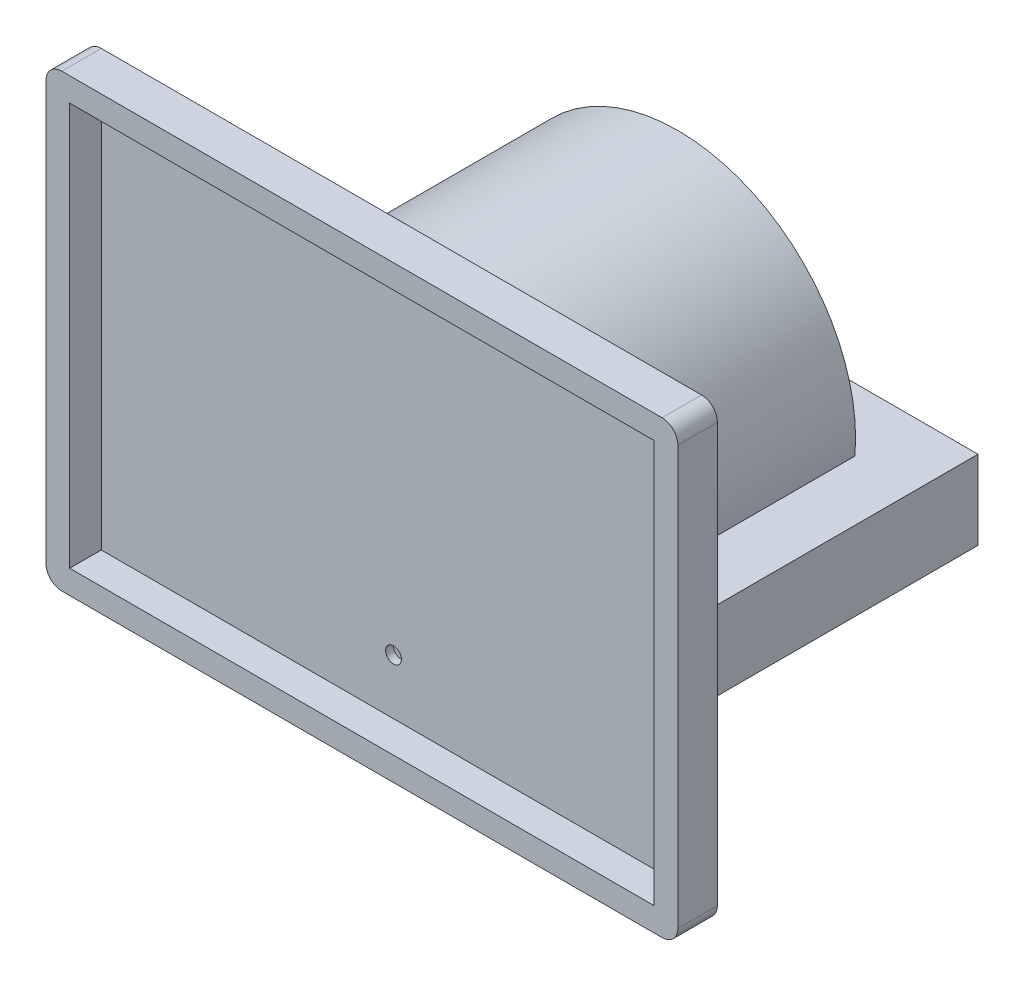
ISO-10303-21;
HEADER;
FILE_DESCRIPTION(('STEP AP214'),'2;1');
FILE_NAME('part.step','',(''),(''),'','','');
FILE_SCHEMA(('AUTOMOTIVE_DESIGN { 1 0 10303 214 1 1 1 1 }'));
ENDSEC;
DATA;
#1=APPLICATION_CONTEXT('core data for automotive mechanical design processes');
#2=APPLICATION_PROTOCOL_DEFINITION('international standard','automotive_design',2000,#1);
#3=PRODUCT_CONTEXT('',#1,'mechanical');
#4=PRODUCT('Part','Part','',(#3));
#5=PRODUCT_RELATED_PRODUCT_CATEGORY('part','',(#4));
#6=PRODUCT_DEFINITION_FORMATION('','',#4);
#7=PRODUCT_DEFINITION_CONTEXT('part definition',#1,'design');
#8=PRODUCT_DEFINITION('design','',#6,#7);
#9=PRODUCT_DEFINITION_SHAPE('','',#8);
#10=(LENGTH_UNIT() NAMED_UNIT(*) SI_UNIT(.MILLI.,.METRE.));
#11=(NAMED_UNIT(*) PLANE_ANGLE_UNIT() SI_UNIT($,.RADIAN.));
#12=(NAMED_UNIT(*) SI_UNIT($,.STERADIAN.) SOLID_ANGLE_UNIT());
#13=UNCERTAINTY_MEASURE_WITH_UNIT(LENGTH_MEASURE(1.E-05),#10,'distance_accuracy_value','');
#14=(GEOMETRIC_REPRESENTATION_CONTEXT(3) GLOBAL_UNCERTAINTY_ASSIGNED_CONTEXT((#13)) GLOBAL_UNIT_ASSIGNED_CONTEXT((#10,
#11,#12)) REPRESENTATION_CONTEXT('',''));
#15=CARTESIAN_POINT('',(0.,0.,0.));
#16=DIRECTION('',(0.,0.,1.));
#17=DIRECTION('',(1.,0.,0.));
#18=AXIS2_PLACEMENT_3D('',#15,#16,#17);
#19=CARTESIAN_POINT('',(0.,0.,0.));
#20=DIRECTION('',(0.,0.,1.));
#21=DIRECTION('',(1.,0.,0.));
#22=AXIS2_PLACEMENT_3D('',#19,#20,#21);
#23=PLANE('',#22);
#24=DIRECTION('',(0.,-1.,0.));
#25=VECTOR('',#24,1.);
#26=CARTESIAN_POINT('',(-80.,57.,0.));
#27=LINE('',#26,#25);
#28=CARTESIAN_POINT('',(-80.,55.,0.));
#29=VERTEX_POINT('',#28);
#30=CARTESIAN_POINT('',(-80.,2.00000000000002,0.));
#31=VERTEX_POINT('',#30);
#32=EDGE_CURVE('E442',#29,#31,#27,.T.);
#33=ORIENTED_EDGE('',*,*,#32,.F.);
#34=CARTESIAN_POINT('',(-78.,55.,0.));
#35=DIRECTION('',(0.,0.,1.));
#36=DIRECTION('',(1.,0.,0.));
#37=AXIS2_PLACEMENT_3D('',#34,#35,#36);
#38=CIRCLE('',#37,2.);
#39=CARTESIAN_POINT('',(-78.,57.,0.));
#40=VERTEX_POINT('',#39);
#41=EDGE_CURVE('E568',#29,#40,#38,.F.);
#42=ORIENTED_EDGE('',*,*,#41,.T.);
#43=DIRECTION('',(-1.,0.,0.));
#44=VECTOR('',#43,1.);
#45=CARTESIAN_POINT('',(-80.,57.,0.));
#46=LINE('',#45,#44);
#47=CARTESIAN_POINT('',(-2.,57.,0.));
#48=VERTEX_POINT('',#47);
#49=EDGE_CURVE('E453',#48,#40,#46,.T.);
#50=ORIENTED_EDGE('',*,*,#49,.F.);
#51=CARTESIAN_POINT('',(-2.,55.,0.));
#52=DIRECTION('',(0.,0.,1.));
#53=DIRECTION('',(1.,0.,0.));
#54=AXIS2_PLACEMENT_3D('',#51,#52,#53);
#55=CIRCLE('',#54,2.);
#56=CARTESIAN_POINT('',(0.,55.,0.));
#57=VERTEX_POINT('',#56);
#58=EDGE_CURVE('E566',#48,#57,#55,.F.);
#59=ORIENTED_EDGE('',*,*,#58,.T.);
#60=DIRECTION('',(0.,1.,0.));
#61=VECTOR('',#60,1.);
#62=CARTESIAN_POINT('',(0.,57.,0.));
#63=LINE('',#62,#61);
#64=CARTESIAN_POINT('',(0.,2.00000000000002,0.));
#65=VERTEX_POINT('',#64);
#66=EDGE_CURVE('E464',#65,#57,#63,.T.);
#67=ORIENTED_EDGE('',*,*,#66,.F.);
#68=CARTESIAN_POINT('',(-2.,2.,0.));
#69=DIRECTION('',(0.,0.,1.));
#70=DIRECTION('',(1.,0.,0.));
#71=AXIS2_PLACEMENT_3D('',#68,#69,#70);
#72=CIRCLE('',#71,2.);
#73=CARTESIAN_POINT('',(-2.,0.,0.));
#74=VERTEX_POINT('',#73);
#75=EDGE_CURVE('E565',#65,#74,#72,.F.);
#76=ORIENTED_EDGE('',*,*,#75,.T.);
#77=DIRECTION('',(1.,0.,0.));
#78=VECTOR('',#77,1.);
#79=CARTESIAN_POINT('',(-80.,0.,0.));
#80=LINE('',#79,#78);
#81=CARTESIAN_POINT('',(-78.,0.,0.));
#82=VERTEX_POINT('',#81);
#83=EDGE_CURVE('E461',#82,#74,#80,.T.);
#84=ORIENTED_EDGE('',*,*,#83,.F.);
#85=CARTESIAN_POINT('',(-78.,2.,0.));
#86=DIRECTION('',(0.,0.,1.));
#87=DIRECTION('',(1.,0.,0.));
#88=AXIS2_PLACEMENT_3D('',#85,#86,#87);
#89=CIRCLE('',#88,2.);
#90=EDGE_CURVE('E563',#82,#31,#89,.F.);
#91=ORIENTED_EDGE('',*,*,#90,.T.);
#92=EDGE_LOOP('',(#33,#42,#50,#59,#67,#76,#84,#91));
#93=FACE_BOUND('',#92,.T.);
#94=DIRECTION('',(0.,-1.,0.));
#95=VECTOR('',#94,1.);
#96=CARTESIAN_POINT('',(-8.,51.,0.));
#97=LINE('',#96,#95);
#98=CARTESIAN_POINT('',(-8.,51.,0.));
#99=VERTEX_POINT('',#98);
#100=CARTESIAN_POINT('',(-8.00000000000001,2.,0.));
#101=VERTEX_POINT('',#100);
#102=EDGE_CURVE('E269',#99,#101,#97,.T.);
#103=ORIENTED_EDGE('',*,*,#102,.F.);
#104=DIRECTION('',(1.,0.,0.));
#105=VECTOR('',#104,1.);
#106=CARTESIAN_POINT('',(-8.,51.,0.));
#107=LINE('',#106,#105);
#108=CARTESIAN_POINT('',(-72.,51.,0.));
#109=VERTEX_POINT('',#108);
#110=EDGE_CURVE('E266',#109,#99,#107,.T.);
#111=ORIENTED_EDGE('',*,*,#110,.F.);
#112=DIRECTION('',(0.,1.,0.));
#113=VECTOR('',#112,1.);
#114=CARTESIAN_POINT('',(-72.,51.,0.));
#115=LINE('',#114,#113);
#116=CARTESIAN_POINT('',(-72.,2.,0.));
#117=VERTEX_POINT('',#116);
#118=EDGE_CURVE('E1043',#117,#109,#115,.T.);
#119=ORIENTED_EDGE('',*,*,#118,.F.);
#120=DIRECTION('',(-1.,0.,0.));
#121=VECTOR('',#120,1.);
#122=CARTESIAN_POINT('',(-8.00000000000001,2.,0.));
#123=LINE('',#122,#121);
#124=EDGE_CURVE('E1045',#101,#117,#123,.T.);
#125=ORIENTED_EDGE('',*,*,#124,.F.);
#126=EDGE_LOOP('',(#103,#111,#119,#125));
#127=FACE_BOUND('',#126,.T.);
#128=ADVANCED_FACE('F34',(#93,#127),#23,.F.);
#129=CARTESIAN_POINT('',(-80.,57.,5.));
#130=DIRECTION('',(1.,0.,0.));
#131=DIRECTION('',(0.,0.,-1.));
#132=AXIS2_PLACEMENT_3D('',#129,#130,#131);
#133=PLANE('',#132);
#134=DIRECTION('',(0.,-1.,0.));
#135=VECTOR('',#134,1.);
#136=CARTESIAN_POINT('',(-80.,57.,5.));
#137=LINE('',#136,#135);
#138=CARTESIAN_POINT('',(-80.,55.,5.));
#139=VERTEX_POINT('',#138);
#140=CARTESIAN_POINT('',(-80.,2.00000000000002,5.));
#141=VERTEX_POINT('',#140);
#142=EDGE_CURVE('E449',#139,#141,#137,.T.);
#143=ORIENTED_EDGE('',*,*,#142,.F.);
#144=DIRECTION('',(0.,0.,-1.));
#145=VECTOR('',#144,1.);
#146=CARTESIAN_POINT('',(-80.,55.,5.));
#147=LINE('',#146,#145);
#148=EDGE_CURVE('E570',#139,#29,#147,.T.);
#149=ORIENTED_EDGE('',*,*,#148,.T.);
#150=ORIENTED_EDGE('',*,*,#32,.T.);
#151=DIRECTION('',(0.,0.,-1.));
#152=VECTOR('',#151,1.);
#153=CARTESIAN_POINT('',(-80.,2.,5.));
#154=LINE('',#153,#152);
#155=EDGE_CURVE('E586',#31,#141,#154,.F.);
#156=ORIENTED_EDGE('',*,*,#155,.T.);
#157=EDGE_LOOP('',(#143,#149,#150,#156));
#158=FACE_BOUND('',#157,.T.);
#159=ADVANCED_FACE('F503',(#158),#133,.F.);
#160=CARTESIAN_POINT('',(-80.,0.,5.));
#161=DIRECTION('',(0.,1.,0.));
#162=DIRECTION('',(0.,0.,1.));
#163=AXIS2_PLACEMENT_3D('',#160,#161,#162);
#164=PLANE('',#163);
#165=DIRECTION('',(1.,0.,0.));
#166=VECTOR('',#165,1.);
#167=CARTESIAN_POINT('',(-80.,0.,5.));
#168=LINE('',#167,#166);
#169=CARTESIAN_POINT('',(-78.,0.,5.));
#170=VERTEX_POINT('',#169);
#171=CARTESIAN_POINT('',(-2.,0.,5.));
#172=VERTEX_POINT('',#171);
#173=EDGE_CURVE('E452',#170,#172,#168,.T.);
#174=ORIENTED_EDGE('',*,*,#173,.F.);
#175=DIRECTION('',(0.,0.,-1.));
#176=VECTOR('',#175,1.);
#177=CARTESIAN_POINT('',(-78.,0.,5.));
#178=LINE('',#177,#176);
#179=EDGE_CURVE('E557',#170,#82,#178,.T.);
#180=ORIENTED_EDGE('',*,*,#179,.T.);
#181=ORIENTED_EDGE('',*,*,#83,.T.);
#182=DIRECTION('',(0.,0.,-1.));
#183=VECTOR('',#182,1.);
#184=CARTESIAN_POINT('',(-2.,0.,5.));
#185=LINE('',#184,#183);
#186=EDGE_CURVE('E545',#74,#172,#185,.F.);
#187=ORIENTED_EDGE('',*,*,#186,.T.);
#188=EDGE_LOOP('',(#174,#180,#181,#187));
#189=FACE_BOUND('',#188,.T.);
#190=ADVANCED_FACE('F509',(#189),#164,.F.);
#191=CARTESIAN_POINT('',(0.,57.,5.));
#192=DIRECTION('',(-1.,0.,0.));
#193=DIRECTION('',(0.,0.,1.));
#194=AXIS2_PLACEMENT_3D('',#191,#192,#193);
#195=PLANE('',#194);
#196=DIRECTION('',(0.,1.,0.));
#197=VECTOR('',#196,1.);
#198=CARTESIAN_POINT('',(0.,57.,5.));
#199=LINE('',#198,#197);
#200=CARTESIAN_POINT('',(0.,2.00000000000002,5.));
#201=VERTEX_POINT('',#200);
#202=CARTESIAN_POINT('',(0.,55.,5.));
#203=VERTEX_POINT('',#202);
#204=EDGE_CURVE('E455',#201,#203,#199,.T.);
#205=ORIENTED_EDGE('',*,*,#204,.F.);
#206=DIRECTION('',(0.,0.,-1.));
#207=VECTOR('',#206,1.);
#208=CARTESIAN_POINT('',(0.,2.,5.));
#209=LINE('',#208,#207);
#210=EDGE_CURVE('E11',#201,#65,#209,.T.);
#211=ORIENTED_EDGE('',*,*,#210,.T.);
#212=ORIENTED_EDGE('',*,*,#66,.T.);
#213=DIRECTION('',(0.,0.,-1.));
#214=VECTOR('',#213,1.);
#215=CARTESIAN_POINT('',(0.,55.,5.));
#216=LINE('',#215,#214);
#217=EDGE_CURVE('E42',#57,#203,#216,.F.);
#218=ORIENTED_EDGE('',*,*,#217,.T.);
#219=EDGE_LOOP('',(#205,#211,#212,#218));
#220=FACE_BOUND('',#219,.T.);
#221=ADVANCED_FACE('F521',(#220),#195,.F.);
#222=CARTESIAN_POINT('',(-80.,57.,5.));
#223=DIRECTION('',(0.,-1.,0.));
#224=DIRECTION('',(0.,0.,-1.));
#225=AXIS2_PLACEMENT_3D('',#222,#223,#224);
#226=PLANE('',#225);
#227=ORIENTED_EDGE('',*,*,#49,.T.);
#228=DIRECTION('',(0.,0.,-1.));
#229=VECTOR('',#228,1.);
#230=CARTESIAN_POINT('',(-78.,57.,5.));
#231=LINE('',#230,#229);
#232=CARTESIAN_POINT('',(-78.,57.,5.));
#233=VERTEX_POINT('',#232);
#234=EDGE_CURVE('E551',#40,#233,#231,.F.);
#235=ORIENTED_EDGE('',*,*,#234,.T.);
#236=DIRECTION('',(-1.,0.,0.));
#237=VECTOR('',#236,1.);
#238=CARTESIAN_POINT('',(-80.,57.,5.));
#239=LINE('',#238,#237);
#240=CARTESIAN_POINT('',(-2.,57.,5.));
#241=VERTEX_POINT('',#240);
#242=EDGE_CURVE('E389',#241,#233,#239,.T.);
#243=ORIENTED_EDGE('',*,*,#242,.F.);
#244=DIRECTION('',(0.,0.,-1.));
#245=VECTOR('',#244,1.);
#246=CARTESIAN_POINT('',(-2.,57.,5.));
#247=LINE('',#246,#245);
#248=EDGE_CURVE('E575',#241,#48,#247,.T.);
#249=ORIENTED_EDGE('',*,*,#248,.T.);
#250=EDGE_LOOP('',(#227,#235,#243,#249));
#251=FACE_BOUND('',#250,.T.);
#252=ADVANCED_FACE('F518',(#251),#226,.F.);
#253=CARTESIAN_POINT('',(0.,0.,5.));
#254=DIRECTION('',(0.,0.,1.));
#255=DIRECTION('',(1.,0.,0.));
#256=AXIS2_PLACEMENT_3D('',#253,#254,#255);
#257=PLANE('',#256);
#258=DIRECTION('',(0.,-1.,0.));
#259=VECTOR('',#258,1.);
#260=CARTESIAN_POINT('',(-77.,54.,5.));
#261=LINE('',#260,#259);
#262=CARTESIAN_POINT('',(-77.,54.,5.));
#263=VERTEX_POINT('',#262);
#264=CARTESIAN_POINT('',(-77.,3.,5.));
#265=VERTEX_POINT('',#264);
#266=EDGE_CURVE('E413',#263,#265,#261,.T.);
#267=ORIENTED_EDGE('',*,*,#266,.F.);
#268=DIRECTION('',(-1.,0.,0.));
#269=VECTOR('',#268,1.);
#270=CARTESIAN_POINT('',(-77.,54.,5.));
#271=LINE('',#270,#269);
#272=CARTESIAN_POINT('',(-3.,54.,5.));
#273=VERTEX_POINT('',#272);
#274=EDGE_CURVE('E421',#273,#263,#271,.T.);
#275=ORIENTED_EDGE('',*,*,#274,.F.);
#276=DIRECTION('',(0.,1.,0.));
#277=VECTOR('',#276,1.);
#278=CARTESIAN_POINT('',(-3.,54.,5.));
#279=LINE('',#278,#277);
#280=CARTESIAN_POINT('',(-3.,3.,5.));
#281=VERTEX_POINT('',#280);
#282=EDGE_CURVE('E435',#281,#273,#279,.T.);
#283=ORIENTED_EDGE('',*,*,#282,.F.);
#284=DIRECTION('',(1.,0.,0.));
#285=VECTOR('',#284,1.);
#286=CARTESIAN_POINT('',(-77.,3.,5.));
#287=LINE('',#286,#285);
#288=EDGE_CURVE('E432',#265,#281,#287,.T.);
#289=ORIENTED_EDGE('',*,*,#288,.F.);
#290=EDGE_LOOP('',(#267,#275,#283,#289));
#291=FACE_BOUND('',#290,.T.);
#292=ORIENTED_EDGE('',*,*,#242,.T.);
#293=CARTESIAN_POINT('',(-78.,55.,5.));
#294=DIRECTION('',(0.,0.,1.));
#295=DIRECTION('',(1.,0.,0.));
#296=AXIS2_PLACEMENT_3D('',#293,#294,#295);
#297=CIRCLE('',#296,2.);
#298=EDGE_CURVE('E549',#233,#139,#297,.T.);
#299=ORIENTED_EDGE('',*,*,#298,.T.);
#300=ORIENTED_EDGE('',*,*,#142,.T.);
#301=CARTESIAN_POINT('',(-78.,2.,5.));
#302=DIRECTION('',(0.,0.,1.));
#303=DIRECTION('',(1.,0.,0.));
#304=AXIS2_PLACEMENT_3D('',#301,#302,#303);
#305=CIRCLE('',#304,2.);
#306=EDGE_CURVE('E546',#141,#170,#305,.T.);
#307=ORIENTED_EDGE('',*,*,#306,.T.);
#308=ORIENTED_EDGE('',*,*,#173,.T.);
#309=CARTESIAN_POINT('',(-2.,2.,5.));
#310=DIRECTION('',(0.,0.,1.));
#311=DIRECTION('',(1.,0.,0.));
#312=AXIS2_PLACEMENT_3D('',#309,#310,#311);
#313=CIRCLE('',#312,2.);
#314=EDGE_CURVE('E55',#172,#201,#313,.T.);
#315=ORIENTED_EDGE('',*,*,#314,.T.);
#316=ORIENTED_EDGE('',*,*,#204,.T.);
#317=CARTESIAN_POINT('',(-2.,55.,5.));
#318=DIRECTION('',(0.,0.,1.));
#319=DIRECTION('',(1.,0.,0.));
#320=AXIS2_PLACEMENT_3D('',#317,#318,#319);
#321=CIRCLE('',#320,2.);
#322=EDGE_CURVE('E547',#203,#241,#321,.T.);
#323=ORIENTED_EDGE('',*,*,#322,.T.);
#324=EDGE_LOOP('',(#292,#299,#300,#307,#308,#315,#316,#323));
#325=FACE_BOUND('',#324,.T.);
#326=ADVANCED_FACE('F516',(#291,#325),#257,.T.);
#327=CARTESIAN_POINT('',(-77.,54.,1.));
#328=DIRECTION('',(-1.,0.,0.));
#329=DIRECTION('',(0.,0.,1.));
#330=AXIS2_PLACEMENT_3D('',#327,#328,#329);
#331=PLANE('',#330);
#332=ORIENTED_EDGE('',*,*,#266,.T.);
#333=DIRECTION('',(0.,0.,1.));
#334=VECTOR('',#333,1.);
#335=CARTESIAN_POINT('',(-77.,3.,1.));
#336=LINE('',#335,#334);
#337=CARTESIAN_POINT('',(-77.,3.,1.));
#338=VERTEX_POINT('',#337);
#339=EDGE_CURVE('E430',#338,#265,#336,.T.);
#340=ORIENTED_EDGE('',*,*,#339,.F.);
#341=DIRECTION('',(0.,-1.,0.));
#342=VECTOR('',#341,1.);
#343=CARTESIAN_POINT('',(-77.,54.,1.));
#344=LINE('',#343,#342);
#345=CARTESIAN_POINT('',(-77.,54.,1.));
#346=VERTEX_POINT('',#345);
#347=EDGE_CURVE('E417',#346,#338,#344,.T.);
#348=ORIENTED_EDGE('',*,*,#347,.F.);
#349=DIRECTION('',(0.,0.,1.));
#350=VECTOR('',#349,1.);
#351=CARTESIAN_POINT('',(-77.,54.,1.));
#352=LINE('',#351,#350);
#353=EDGE_CURVE('E440',#346,#263,#352,.T.);
#354=ORIENTED_EDGE('',*,*,#353,.T.);
#355=EDGE_LOOP('',(#332,#340,#348,#354));
#356=FACE_BOUND('',#355,.T.);
#357=ADVANCED_FACE('F647',(#356),#331,.F.);
#358=CARTESIAN_POINT('',(-77.,54.,1.));
#359=DIRECTION('',(0.,1.,0.));
#360=DIRECTION('',(0.,0.,1.));
#361=AXIS2_PLACEMENT_3D('',#358,#359,#360);
#362=PLANE('',#361);
#363=ORIENTED_EDGE('',*,*,#274,.T.);
#364=ORIENTED_EDGE('',*,*,#353,.F.);
#365=DIRECTION('',(-1.,0.,0.));
#366=VECTOR('',#365,1.);
#367=CARTESIAN_POINT('',(-77.,54.,1.));
#368=LINE('',#367,#366);
#369=CARTESIAN_POINT('',(-3.,54.,1.));
#370=VERTEX_POINT('',#369);
#371=EDGE_CURVE('E427',#370,#346,#368,.T.);
#372=ORIENTED_EDGE('',*,*,#371,.F.);
#373=DIRECTION('',(0.,0.,1.));
#374=VECTOR('',#373,1.);
#375=CARTESIAN_POINT('',(-3.,54.,1.));
#376=LINE('',#375,#374);
#377=EDGE_CURVE('E443',#370,#273,#376,.T.);
#378=ORIENTED_EDGE('',*,*,#377,.T.);
#379=EDGE_LOOP('',(#363,#364,#372,#378));
#380=FACE_BOUND('',#379,.T.);
#381=ADVANCED_FACE('F643',(#380),#362,.F.);
#382=CARTESIAN_POINT('',(-3.,54.,1.));
#383=DIRECTION('',(1.,0.,0.));
#384=DIRECTION('',(0.,0.,-1.));
#385=AXIS2_PLACEMENT_3D('',#382,#383,#384);
#386=PLANE('',#385);
#387=ORIENTED_EDGE('',*,*,#282,.T.);
#388=ORIENTED_EDGE('',*,*,#377,.F.);
#389=DIRECTION('',(0.,1.,0.));
#390=VECTOR('',#389,1.);
#391=CARTESIAN_POINT('',(-3.,54.,1.));
#392=LINE('',#391,#390);
#393=CARTESIAN_POINT('',(-3.,3.,1.));
#394=VERTEX_POINT('',#393);
#395=EDGE_CURVE('E424',#394,#370,#392,.T.);
#396=ORIENTED_EDGE('',*,*,#395,.F.);
#397=DIRECTION('',(0.,0.,1.));
#398=VECTOR('',#397,1.);
#399=CARTESIAN_POINT('',(-3.,3.,1.));
#400=LINE('',#399,#398);
#401=EDGE_CURVE('E445',#394,#281,#400,.T.);
#402=ORIENTED_EDGE('',*,*,#401,.T.);
#403=EDGE_LOOP('',(#387,#388,#396,#402));
#404=FACE_BOUND('',#403,.T.);
#405=ADVANCED_FACE('F646',(#404),#386,.F.);
#406=CARTESIAN_POINT('',(-77.,3.,1.));
#407=DIRECTION('',(0.,-1.,0.));
#408=DIRECTION('',(0.,0.,-1.));
#409=AXIS2_PLACEMENT_3D('',#406,#407,#408);
#410=PLANE('',#409);
#411=ORIENTED_EDGE('',*,*,#288,.T.);
#412=ORIENTED_EDGE('',*,*,#401,.F.);
#413=DIRECTION('',(1.,0.,0.));
#414=VECTOR('',#413,1.);
#415=CARTESIAN_POINT('',(-77.,3.,1.));
#416=LINE('',#415,#414);
#417=EDGE_CURVE('E420',#338,#394,#416,.T.);
#418=ORIENTED_EDGE('',*,*,#417,.F.);
#419=ORIENTED_EDGE('',*,*,#339,.T.);
#420=EDGE_LOOP('',(#411,#412,#418,#419));
#421=FACE_BOUND('',#420,.T.);
#422=ADVANCED_FACE('F641',(#421),#410,.F.);
#423=CARTESIAN_POINT('',(0.,0.,1.));
#424=DIRECTION('',(0.,0.,1.));
#425=DIRECTION('',(1.,0.,0.));
#426=AXIS2_PLACEMENT_3D('',#423,#424,#425);
#427=PLANE('',#426);
#428=CARTESIAN_POINT('',(-40.,10.,1.));
#429=DIRECTION('',(0.,0.,1.));
#430=DIRECTION('',(1.,0.,0.));
#431=AXIS2_PLACEMENT_3D('',#428,#429,#430);
#432=CIRCLE('',#431,0.999999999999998);
#433=CARTESIAN_POINT('',(-39.,10.,1.));
#434=VERTEX_POINT('',#433);
#435=EDGE_CURVE('E414',#434,#434,#432,.T.);
#436=ORIENTED_EDGE('',*,*,#435,.F.);
#437=EDGE_LOOP('',(#436));
#438=FACE_BOUND('',#437,.T.);
#439=ORIENTED_EDGE('',*,*,#347,.T.);
#440=ORIENTED_EDGE('',*,*,#417,.T.);
#441=ORIENTED_EDGE('',*,*,#395,.T.);
#442=ORIENTED_EDGE('',*,*,#371,.T.);
#443=EDGE_LOOP('',(#439,#440,#441,#442));
#444=FACE_BOUND('',#443,.T.);
#445=ADVANCED_FACE('F637',(#438,#444),#427,.T.);
#446=CARTESIAN_POINT('',(-40.,10.,0.));
#447=DIRECTION('',(0.,0.,1.));
#448=DIRECTION('',(1.,0.,0.));
#449=AXIS2_PLACEMENT_3D('',#446,#447,#448);
#450=CYLINDRICAL_SURFACE('',#449,0.999999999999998);
#451=CARTESIAN_POINT('',(-40.,10.,0.));
#452=DIRECTION('',(0.,0.,1.));
#453=DIRECTION('',(1.,0.,0.));
#454=AXIS2_PLACEMENT_3D('',#451,#452,#453);
#455=CIRCLE('',#454,0.999999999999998);
#456=CARTESIAN_POINT('',(-39.,10.,0.));
#457=VERTEX_POINT('',#456);
#458=EDGE_CURVE('E410',#457,#457,#455,.T.);
#459=ORIENTED_EDGE('',*,*,#458,.F.);
#460=EDGE_LOOP('',(#459));
#461=FACE_BOUND('',#460,.T.);
#462=ORIENTED_EDGE('',*,*,#435,.T.);
#463=EDGE_LOOP('',(#462));
#464=FACE_BOUND('',#463,.T.);
#465=ADVANCED_FACE('F631',(#461,#464),#450,.F.);
#466=CARTESIAN_POINT('',(-40.,27.,0.));
#467=DIRECTION('',(0.,0.,-1.));
#468=DIRECTION('',(-1.,0.,0.));
#469=AXIS2_PLACEMENT_3D('',#466,#467,#468);
#470=PLANE('',#469);
#471=ORIENTED_EDGE('',*,*,#458,.T.);
#472=EDGE_LOOP('',(#471));
#473=FACE_BOUND('',#472,.T.);
#474=ADVANCED_FACE('F628',(#473),#470,.F.);
#475=CARTESIAN_POINT('',(0.,0.,-1.));
#476=DIRECTION('',(0.,0.,-1.));
#477=DIRECTION('',(-1.,0.,0.));
#478=AXIS2_PLACEMENT_3D('',#475,#476,#477);
#479=PLANE('',#478);
#480=DIRECTION('',(0.,-1.,0.));
#481=VECTOR('',#480,1.);
#482=CARTESIAN_POINT('',(-8.,51.,-1.));
#483=LINE('',#482,#481);
#484=CARTESIAN_POINT('',(-8.,51.,-1.));
#485=VERTEX_POINT('',#484);
#486=CARTESIAN_POINT('',(-8.00000000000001,2.,-1.));
#487=VERTEX_POINT('',#486);
#488=EDGE_CURVE('E256',#485,#487,#483,.T.);
#489=ORIENTED_EDGE('',*,*,#488,.T.);
#490=DIRECTION('',(-1.,0.,0.));
#491=VECTOR('',#490,1.);
#492=CARTESIAN_POINT('',(-8.00000000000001,2.,-1.));
#493=LINE('',#492,#491);
#494=CARTESIAN_POINT('',(-72.,2.,-1.));
#495=VERTEX_POINT('',#494);
#496=EDGE_CURVE('E244',#487,#495,#493,.T.);
#497=ORIENTED_EDGE('',*,*,#496,.T.);
#498=DIRECTION('',(0.,1.,0.));
#499=VECTOR('',#498,1.);
#500=CARTESIAN_POINT('',(-72.,51.,-1.));
#501=LINE('',#500,#499);
#502=CARTESIAN_POINT('',(-72.,51.,-1.));
#503=VERTEX_POINT('',#502);
#504=EDGE_CURVE('E255',#495,#503,#501,.T.);
#505=ORIENTED_EDGE('',*,*,#504,.T.);
#506=DIRECTION('',(1.,0.,0.));
#507=VECTOR('',#506,1.);
#508=CARTESIAN_POINT('',(-8.,51.,-1.));
#509=LINE('',#508,#507);
#510=EDGE_CURVE('E262',#503,#485,#509,.T.);
#511=ORIENTED_EDGE('',*,*,#510,.T.);
#512=EDGE_LOOP('',(#489,#497,#505,#511));
#513=FACE_BOUND('',#512,.T.);
#514=DIRECTION('',(1.,0.,0.));
#515=VECTOR('',#514,1.);
#516=CARTESIAN_POINT('',(-10.,25.,-1.));
#517=LINE('',#516,#515);
#518=CARTESIAN_POINT('',(-17.589065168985,25.,-1.));
#519=VERTEX_POINT('',#518);
#520=CARTESIAN_POINT('',(-10.,25.,-1.));
#521=VERTEX_POINT('',#520);
#522=EDGE_CURVE('E285',#519,#521,#517,.T.);
#523=ORIENTED_EDGE('',*,*,#522,.F.);
#524=CARTESIAN_POINT('',(-40.,27.,-1.));
#525=DIRECTION('',(0.,0.,-1.));
#526=DIRECTION('',(-1.,0.,0.));
#527=AXIS2_PLACEMENT_3D('',#524,#525,#526);
#528=CIRCLE('',#527,22.5);
#529=CARTESIAN_POINT('',(-62.410934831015,25.,-1.));
#530=VERTEX_POINT('',#529);
#531=EDGE_CURVE('E289',#530,#519,#528,.T.);
#532=ORIENTED_EDGE('',*,*,#531,.F.);
#533=CARTESIAN_POINT('',(-70.,25.,-1.));
#534=VERTEX_POINT('',#533);
#535=EDGE_CURVE('E282',#534,#530,#517,.T.);
#536=ORIENTED_EDGE('',*,*,#535,.F.);
#537=DIRECTION('',(0.,1.,0.));
#538=VECTOR('',#537,1.);
#539=CARTESIAN_POINT('',(-70.,25.,-1.));
#540=LINE('',#539,#538);
#541=CARTESIAN_POINT('',(-70.,15.,-1.));
#542=VERTEX_POINT('',#541);
#543=EDGE_CURVE('E393',#542,#534,#540,.T.);
#544=ORIENTED_EDGE('',*,*,#543,.F.);
#545=DIRECTION('',(-1.,0.,0.));
#546=VECTOR('',#545,1.);
#547=CARTESIAN_POINT('',(-10.,15.,-1.));
#548=LINE('',#547,#546);
#549=CARTESIAN_POINT('',(-59.0328663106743,15.,-1.));
#550=VERTEX_POINT('',#549);
#551=EDGE_CURVE('E270',#550,#542,#548,.T.);
#552=ORIENTED_EDGE('',*,*,#551,.F.);
#553=CARTESIAN_POINT('',(-40.,27.,-1.));
#554=DIRECTION('',(0.,0.,-1.));
#555=DIRECTION('',(-1.,0.,0.));
#556=AXIS2_PLACEMENT_3D('',#553,#554,#555);
#557=CIRCLE('',#556,22.5);
#558=CARTESIAN_POINT('',(-20.9671336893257,15.,-1.));
#559=VERTEX_POINT('',#558);
#560=EDGE_CURVE('E273',#559,#550,#557,.T.);
#561=ORIENTED_EDGE('',*,*,#560,.F.);
#562=CARTESIAN_POINT('',(-10.,15.,-1.));
#563=VERTEX_POINT('',#562);
#564=EDGE_CURVE('E275',#563,#559,#548,.T.);
#565=ORIENTED_EDGE('',*,*,#564,.F.);
#566=DIRECTION('',(0.,-1.,0.));
#567=VECTOR('',#566,1.);
#568=CARTESIAN_POINT('',(-10.,25.,-1.));
#569=LINE('',#568,#567);
#570=EDGE_CURVE('E286',#521,#563,#569,.T.);
#571=ORIENTED_EDGE('',*,*,#570,.F.);
#572=EDGE_LOOP('',(#523,#532,#536,#544,#552,#561,#565,#571));
#573=FACE_BOUND('',#572,.T.);
#574=ADVANCED_FACE('F259',(#513,#573),#479,.T.);
#575=CARTESIAN_POINT('',(-8.,51.,-1.));
#576=DIRECTION('',(-1.,0.,0.));
#577=DIRECTION('',(0.,-1.,0.));
#578=AXIS2_PLACEMENT_3D('',#575,#576,#577);
#579=PLANE('',#578);
#580=ORIENTED_EDGE('',*,*,#102,.T.);
#581=DIRECTION('',(0.,0.,1.));
#582=VECTOR('',#581,1.);
#583=CARTESIAN_POINT('',(-8.00000000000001,2.,-1.));
#584=LINE('',#583,#582);
#585=EDGE_CURVE('E249',#487,#101,#584,.T.);
#586=ORIENTED_EDGE('',*,*,#585,.F.);
#587=ORIENTED_EDGE('',*,*,#488,.F.);
#588=DIRECTION('',(0.,0.,1.));
#589=VECTOR('',#588,1.);
#590=CARTESIAN_POINT('',(-8.,51.,-1.));
#591=LINE('',#590,#589);
#592=EDGE_CURVE('E1048',#485,#99,#591,.T.);
#593=ORIENTED_EDGE('',*,*,#592,.T.);
#594=EDGE_LOOP('',(#580,#586,#587,#593));
#595=FACE_BOUND('',#594,.T.);
#596=ADVANCED_FACE('F268',(#595),#579,.F.);
#597=CARTESIAN_POINT('',(-8.00000000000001,2.,-1.));
#598=DIRECTION('',(0.,1.,0.));
#599=DIRECTION('',(0.,0.,1.));
#600=AXIS2_PLACEMENT_3D('',#597,#598,#599);
#601=PLANE('',#600);
#602=ORIENTED_EDGE('',*,*,#124,.T.);
#603=DIRECTION('',(0.,0.,1.));
#604=VECTOR('',#603,1.);
#605=CARTESIAN_POINT('',(-72.,2.,-1.));
#606=LINE('',#605,#604);
#607=EDGE_CURVE('E252',#495,#117,#606,.T.);
#608=ORIENTED_EDGE('',*,*,#607,.F.);
#609=ORIENTED_EDGE('',*,*,#496,.F.);
#610=ORIENTED_EDGE('',*,*,#585,.T.);
#611=EDGE_LOOP('',(#602,#608,#609,#610));
#612=FACE_BOUND('',#611,.T.);
#613=ADVANCED_FACE('F247',(#612),#601,.F.);
#614=CARTESIAN_POINT('',(-72.,51.,-1.));
#615=DIRECTION('',(1.,0.,0.));
#616=DIRECTION('',(0.,0.,-1.));
#617=AXIS2_PLACEMENT_3D('',#614,#615,#616);
#618=PLANE('',#617);
#619=ORIENTED_EDGE('',*,*,#118,.T.);
#620=DIRECTION('',(0.,0.,1.));
#621=VECTOR('',#620,1.);
#622=CARTESIAN_POINT('',(-72.,51.,-1.));
#623=LINE('',#622,#621);
#624=EDGE_CURVE('E276',#503,#109,#623,.T.);
#625=ORIENTED_EDGE('',*,*,#624,.F.);
#626=ORIENTED_EDGE('',*,*,#504,.F.);
#627=ORIENTED_EDGE('',*,*,#607,.T.);
#628=EDGE_LOOP('',(#619,#625,#626,#627));
#629=FACE_BOUND('',#628,.T.);
#630=ADVANCED_FACE('F750',(#629),#618,.F.);
#631=CARTESIAN_POINT('',(-8.,51.,-1.));
#632=DIRECTION('',(0.,-1.,0.));
#633=DIRECTION('',(0.,0.,-1.));
#634=AXIS2_PLACEMENT_3D('',#631,#632,#633);
#635=PLANE('',#634);
#636=ORIENTED_EDGE('',*,*,#110,.T.);
#637=ORIENTED_EDGE('',*,*,#592,.F.);
#638=ORIENTED_EDGE('',*,*,#510,.F.);
#639=ORIENTED_EDGE('',*,*,#624,.T.);
#640=EDGE_LOOP('',(#636,#637,#638,#639));
#641=FACE_BOUND('',#640,.T.);
#642=ADVANCED_FACE('F500',(#641),#635,.F.);
#643=CARTESIAN_POINT('',(-32.5,27.5,-35.));
#644=DIRECTION('',(0.,0.,-1.));
#645=DIRECTION('',(-1.,0.,0.));
#646=AXIS2_PLACEMENT_3D('',#643,#644,#645);
#647=PLANE('',#646);
#648=CARTESIAN_POINT('',(-32.5,27.5,-35.));
#649=DIRECTION('',(0.,0.,-1.));
#650=DIRECTION('',(-1.,0.,0.));
#651=AXIS2_PLACEMENT_3D('',#648,#649,#650);
#652=CIRCLE('',#651,1.25);
#653=CARTESIAN_POINT('',(-33.75,27.5,-35.));
#654=VERTEX_POINT('',#653);
#655=EDGE_CURVE('E303',#654,#654,#652,.T.);
#656=ORIENTED_EDGE('',*,*,#655,.T.);
#657=EDGE_LOOP('',(#656));
#658=FACE_BOUND('',#657,.T.);
#659=ADVANCED_FACE('F493',(#658),#647,.T.);
#660=CARTESIAN_POINT('',(-47.5,27.5,-35.));
#661=DIRECTION('',(0.,0.,-1.));
#662=DIRECTION('',(-1.,0.,0.));
#663=AXIS2_PLACEMENT_3D('',#660,#661,#662);
#664=PLANE('',#663);
#665=CARTESIAN_POINT('',(-47.5,27.5,-35.));
#666=DIRECTION('',(0.,0.,-1.));
#667=DIRECTION('',(-1.,0.,0.));
#668=AXIS2_PLACEMENT_3D('',#665,#666,#667);
#669=CIRCLE('',#668,1.25);
#670=CARTESIAN_POINT('',(-48.75,27.5,-35.));
#671=VERTEX_POINT('',#670);
#672=EDGE_CURVE('E304',#671,#671,#669,.T.);
#673=ORIENTED_EDGE('',*,*,#672,.T.);
#674=EDGE_LOOP('',(#673));
#675=FACE_BOUND('',#674,.T.);
#676=ADVANCED_FACE('F491',(#675),#664,.T.);
#677=CARTESIAN_POINT('',(-32.5,27.,-38.5));
#678=DIRECTION('',(0.,1.,0.));
#679=DIRECTION('',(0.,0.,1.));
#680=AXIS2_PLACEMENT_3D('',#677,#678,#679);
#681=CYLINDRICAL_SURFACE('',#680,0.999999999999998);
#682=CARTESIAN_POINT('',(-32.5,28.75,-37.5));
#683=CARTESIAN_POINT('',(-32.5479985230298,28.7499963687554,-37.500003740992));
#684=CARTESIAN_POINT('',(-32.5960666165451,28.7472068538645,-37.5034847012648));
#685=CARTESIAN_POINT('',(-32.6906596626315,28.7362963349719,-37.5171749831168));
#686=CARTESIAN_POINT('',(-32.737180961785,28.7281635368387,-37.5273991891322));
#687=CARTESIAN_POINT('',(-32.8270474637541,28.7073336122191,-37.5538391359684));
#688=CARTESIAN_POINT('',(-32.8704108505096,28.6946656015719,-37.5700166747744));
#689=CARTESIAN_POINT('',(-32.9534631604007,28.6656800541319,-37.60755867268));
#690=CARTESIAN_POINT('',(-32.9931520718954,28.6493625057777,-37.6289231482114));
#691=CARTESIAN_POINT('',(-33.0815906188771,28.6078783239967,-37.6843141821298));
#692=CARTESIAN_POINT('',(-33.128683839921,28.5816087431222,-37.7201594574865));
#693=CARTESIAN_POINT('',(-33.2152068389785,28.5264609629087,-37.7986390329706));
#694=CARTESIAN_POINT('',(-33.2546138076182,28.4975753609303,-37.8412928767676));
#695=CARTESIAN_POINT('',(-33.326079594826,28.4392800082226,-37.9333869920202));
#696=CARTESIAN_POINT('',(-33.3580131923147,28.4098691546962,-37.9829233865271));
#697=CARTESIAN_POINT('',(-33.4132341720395,28.3544105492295,-38.0882693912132));
#698=CARTESIAN_POINT('',(-33.4365504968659,28.3283517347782,-38.1440571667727));
#699=CARTESIAN_POINT('',(-33.4654302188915,28.2941782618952,-38.2369394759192));
#700=CARTESIAN_POINT('',(-33.4743273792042,28.2831436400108,-38.2719058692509));
#701=CARTESIAN_POINT('',(-33.4883669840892,28.2653494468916,-38.3436063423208));
#702=CARTESIAN_POINT('',(-33.4935186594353,28.2585793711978,-38.3803358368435));
#703=CARTESIAN_POINT('',(-33.499699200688,28.2504211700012,-38.4550962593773));
#704=CARTESIAN_POINT('',(-33.5006917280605,28.2490804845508,-38.4931357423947));
#705=CARTESIAN_POINT('',(-33.4983474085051,28.2521998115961,-38.5688524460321));
#706=CARTESIAN_POINT('',(-33.4950068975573,28.2566647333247,-38.6065293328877));
#707=CARTESIAN_POINT('',(-33.4834765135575,28.2716036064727,-38.6861111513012));
#708=CARTESIAN_POINT('',(-33.4746090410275,28.2829092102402,-38.7277540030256));
#709=CARTESIAN_POINT('',(-33.4522227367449,28.3099872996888,-38.80826777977));
#710=CARTESIAN_POINT('',(-33.4386901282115,28.3257729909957,-38.8471300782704));
#711=CARTESIAN_POINT('',(-33.39987051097,28.3682805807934,-38.9403310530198));
#712=CARTESIAN_POINT('',(-33.3720744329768,28.396566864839,-38.9929013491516));
#713=CARTESIAN_POINT('',(-33.3081923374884,28.4545689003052,-39.0918583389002));
#714=CARTESIAN_POINT('',(-33.2720942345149,28.4842866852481,-39.1382358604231));
#715=CARTESIAN_POINT('',(-33.1907290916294,28.5430637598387,-39.2256373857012));
#716=CARTESIAN_POINT('',(-33.145243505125,28.5720844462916,-39.266485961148));
#717=CARTESIAN_POINT('',(-33.0459924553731,28.6258593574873,-39.340049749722));
#718=CARTESIAN_POINT('',(-32.992249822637,28.6506249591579,-39.3727867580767));
#719=CARTESIAN_POINT('',(-32.8938889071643,28.6871229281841,-39.4202814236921));
#720=CARTESIAN_POINT('',(-32.8510888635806,28.7005553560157,-39.4375022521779));
#721=CARTESIAN_POINT('',(-32.7624569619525,28.7229878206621,-39.4660632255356));
#722=CARTESIAN_POINT('',(-32.7166274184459,28.7319911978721,-39.4774078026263));
#723=CARTESIAN_POINT('',(-32.6228566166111,28.7448516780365,-39.4935692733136));
#724=CARTESIAN_POINT('',(-32.5749056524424,28.7486818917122,-39.4983520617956));
#725=CARTESIAN_POINT('',(-32.4786959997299,28.7507434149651,-39.5009295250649));
#726=CARTESIAN_POINT('',(-32.4304373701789,28.7489757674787,-39.4987255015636));
#727=CARTESIAN_POINT('',(-32.3391266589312,28.7403842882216,-39.487958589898));
#728=CARTESIAN_POINT('',(-32.2959695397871,28.7339817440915,-39.4799254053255));
#729=CARTESIAN_POINT('',(-32.2118321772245,28.7170875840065,-39.4585639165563));
#730=CARTESIAN_POINT('',(-32.1708525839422,28.7065947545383,-39.4452340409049));
#731=CARTESIAN_POINT('',(-32.0893820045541,28.6814491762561,-39.4129247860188));
#732=CARTESIAN_POINT('',(-32.0490779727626,28.6665792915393,-39.3936469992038));
#733=CARTESIAN_POINT('',(-31.9722952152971,28.6339183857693,-39.350569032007));
#734=CARTESIAN_POINT('',(-31.9358166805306,28.616127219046,-39.326768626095));
#735=CARTESIAN_POINT('',(-31.8603728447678,28.5749672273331,-39.2703873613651));
#736=CARTESIAN_POINT('',(-31.8222424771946,28.5511799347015,-39.2369972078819));
#737=CARTESIAN_POINT('',(-31.7517355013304,28.5022224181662,-39.1653084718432));
#738=CARTESIAN_POINT('',(-31.7193759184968,28.4770483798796,-39.1269959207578));
#739=CARTESIAN_POINT('',(-31.6543314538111,28.4216976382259,-39.0371741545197));
#740=CARTESIAN_POINT('',(-31.6230502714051,28.3915995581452,-38.9845933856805));
#741=CARTESIAN_POINT('',(-31.5699726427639,28.3360676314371,-38.8726312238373));
#742=CARTESIAN_POINT('',(-31.5481349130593,28.3106137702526,-38.8132808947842));
#743=CARTESIAN_POINT('',(-31.523197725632,28.2800995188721,-38.716946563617));
#744=CARTESIAN_POINT('',(-31.5161018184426,28.271049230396,-38.6822859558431));
#745=CARTESIAN_POINT('',(-31.5056058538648,28.2574662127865,-38.6115838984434));
#746=CARTESIAN_POINT('',(-31.5021964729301,28.2529220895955,-38.5755461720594));
#747=CARTESIAN_POINT('',(-31.4993396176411,28.2491238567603,-38.5028248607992));
#748=CARTESIAN_POINT('',(-31.499913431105,28.2498981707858,-38.4661388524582));
#749=CARTESIAN_POINT('',(-31.5050173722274,28.256653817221,-38.3935083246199));
#750=CARTESIAN_POINT('',(-31.5095537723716,28.2626434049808,-38.3575650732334));
#751=CARTESIAN_POINT('',(-31.5239615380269,28.2810353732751,-38.277695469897));
#752=CARTESIAN_POINT('',(-31.5349550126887,28.2947461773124,-38.2342839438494));
#753=CARTESIAN_POINT('',(-31.5619579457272,28.3264446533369,-38.1506877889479));
#754=CARTESIAN_POINT('',(-31.5779821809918,28.3444448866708,-38.1105131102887));
#755=CARTESIAN_POINT('',(-31.6227948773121,28.3913361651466,-38.0158879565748));
#756=CARTESIAN_POINT('',(-31.6540757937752,28.4214625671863,-37.9632325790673));
#757=CARTESIAN_POINT('',(-31.7254401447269,28.4822263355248,-37.86457656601));
#758=CARTESIAN_POINT('',(-31.7655335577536,28.5128642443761,-37.8185835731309));
#759=CARTESIAN_POINT('',(-31.8549647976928,28.5720759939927,-37.7333225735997));
#760=CARTESIAN_POINT('',(-31.9044162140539,28.6006177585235,-37.6941499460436));
#761=CARTESIAN_POINT('',(-32.0118065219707,28.6522530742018,-37.6249493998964));
#762=CARTESIAN_POINT('',(-32.0697196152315,28.6753626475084,-37.5948945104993));
#763=CARTESIAN_POINT('',(-32.1724983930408,28.7071146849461,-37.5540987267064));
#764=CARTESIAN_POINT('',(-32.2154493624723,28.7180171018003,-37.540255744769));
#765=CARTESIAN_POINT('',(-32.3036389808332,28.7352916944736,-37.5184240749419));
#766=CARTESIAN_POINT('',(-32.3488713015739,28.7416757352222,-37.510420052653));
#767=CARTESIAN_POINT('',(-32.4120597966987,28.7470270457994,-37.5037183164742));
#768=CARTESIAN_POINT('',(-32.4295957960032,28.7481396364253,-37.5023262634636));
#769=CARTESIAN_POINT('',(-32.4647513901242,28.7496268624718,-37.5004663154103));
#770=CARTESIAN_POINT('',(-32.4823710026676,28.7500013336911,-37.4999986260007));
#771=CARTESIAN_POINT('',(-32.5,28.75,-37.5));
#772=B_SPLINE_CURVE_WITH_KNOTS('',3,(#682,#683,#684,#685,#686,#687,#688,#689,#690,#691,#692,
#693,#694,#695,#696,#697,#698,#699,#700,#701,#702,#703,#704,#705,#706,#707,#708,#709,#710,#711,
#712,#713,#714,#715,#716,#717,#718,#719,#720,#721,#722,#723,#724,#725,#726,#727,#728,#729,#730,
#731,#732,#733,#734,#735,#736,#737,#738,#739,#740,#741,#742,#743,#744,#745,#746,#747,#748,#749,
#750,#751,#752,#753,#754,#755,#756,#757,#758,#759,#760,#761,#762,#763,#764,#765,#766,#767,#768,
#769,#770,#771),.UNSPECIFIED.,.T.,.F.,(4,2,2,2,2,2,2,2,2,2,2,2,2,2,2,2,2,2,2,2,2,2,2,2,2,2,2,2,
2,2,2,2,2,2,2,2,2,2,2,2,2,2,2,2,4),(0.,0.14391830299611,0.288155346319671,0.431482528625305,
0.574810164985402,0.768039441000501,0.961833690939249,1.15867370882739,1.35484646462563,
1.46767243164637,1.58021938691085,1.69374764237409,1.80737196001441,1.93879315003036,
2.07060581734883,2.26712874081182,2.46393957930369,2.66599086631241,2.8674932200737,
3.01106989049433,3.15453810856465,3.29874921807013,3.44293346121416,3.5754350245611,
3.70797592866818,3.84871376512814,3.98945862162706,4.15682768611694,4.32468264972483,
4.52835135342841,4.73112045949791,4.84028105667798,4.94916492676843,5.05863116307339,
5.16827099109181,5.30798691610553,5.44811713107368,5.65183909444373,5.85579293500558,
6.0624028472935,6.26839549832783,6.40712300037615,6.54548484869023,6.5983317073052,
6.65119032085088),.UNSPECIFIED.);
#773=CARTESIAN_POINT('',(-32.5,28.75,-37.5));
#774=VERTEX_POINT('',#773);
#775=EDGE_CURVE('E295',#774,#774,#772,.T.);
#776=ORIENTED_EDGE('',*,*,#775,.T.);
#777=EDGE_LOOP('',(#776));
#778=FACE_BOUND('',#777,.T.);
#779=CARTESIAN_POINT('',(-32.5,30.,-38.5));
#780=DIRECTION('',(0.,1.,0.));
#781=DIRECTION('',(0.,0.,1.));
#782=AXIS2_PLACEMENT_3D('',#779,#780,#781);
#783=CIRCLE('',#782,0.999999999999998);
#784=CARTESIAN_POINT('',(-32.5,30.,-37.5));
#785=VERTEX_POINT('',#784);
#786=EDGE_CURVE('E292',#785,#785,#783,.T.);
#787=ORIENTED_EDGE('',*,*,#786,.T.);
#788=EDGE_LOOP('',(#787));
#789=FACE_BOUND('',#788,.T.);
#790=ADVANCED_FACE('F487',(#778,#789),#681,.F.);
#791=CARTESIAN_POINT('',(-47.5,27.,-38.5));
#792=DIRECTION('',(0.,1.,0.));
#793=DIRECTION('',(0.,0.,1.));
#794=AXIS2_PLACEMENT_3D('',#791,#792,#793);
#795=CYLINDRICAL_SURFACE('',#794,0.999999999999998);
#796=CARTESIAN_POINT('',(-47.5,28.75,-37.5));
#797=CARTESIAN_POINT('',(-47.5479985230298,28.7499963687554,-37.500003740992));
#798=CARTESIAN_POINT('',(-47.5960666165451,28.7472068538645,-37.5034847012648));
#799=CARTESIAN_POINT('',(-47.6906596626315,28.7362963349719,-37.5171749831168));
#800=CARTESIAN_POINT('',(-47.737180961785,28.7281635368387,-37.5273991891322));
#801=CARTESIAN_POINT('',(-47.8270474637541,28.7073336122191,-37.5538391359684));
#802=CARTESIAN_POINT('',(-47.8704108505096,28.6946656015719,-37.5700166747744));
#803=CARTESIAN_POINT('',(-47.9534631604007,28.6656800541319,-37.60755867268));
#804=CARTESIAN_POINT('',(-47.9931520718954,28.6493625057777,-37.6289231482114));
#805=CARTESIAN_POINT('',(-48.0815906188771,28.6078783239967,-37.6843141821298));
#806=CARTESIAN_POINT('',(-48.128683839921,28.5816087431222,-37.7201594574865));
#807=CARTESIAN_POINT('',(-48.2152068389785,28.5264609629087,-37.7986390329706));
#808=CARTESIAN_POINT('',(-48.2546138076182,28.4975753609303,-37.8412928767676));
#809=CARTESIAN_POINT('',(-48.326079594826,28.4392800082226,-37.9333869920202));
#810=CARTESIAN_POINT('',(-48.3580131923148,28.4098691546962,-37.9829233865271));
#811=CARTESIAN_POINT('',(-48.4132341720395,28.3544105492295,-38.0882693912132));
#812=CARTESIAN_POINT('',(-48.436550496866,28.3283517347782,-38.1440571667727));
#813=CARTESIAN_POINT('',(-48.4654302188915,28.2941782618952,-38.2369394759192));
#814=CARTESIAN_POINT('',(-48.4743273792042,28.2831436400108,-38.2719058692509));
#815=CARTESIAN_POINT('',(-48.4883669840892,28.2653494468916,-38.3436063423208));
#816=CARTESIAN_POINT('',(-48.4935186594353,28.2585793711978,-38.3803358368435));
#817=CARTESIAN_POINT('',(-48.499699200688,28.2504211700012,-38.4550962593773));
#818=CARTESIAN_POINT('',(-48.5006917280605,28.2490804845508,-38.4931357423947));
#819=CARTESIAN_POINT('',(-48.4983474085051,28.2521998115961,-38.5688524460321));
#820=CARTESIAN_POINT('',(-48.4950068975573,28.2566647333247,-38.6065293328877));
#821=CARTESIAN_POINT('',(-48.4834765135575,28.2716036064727,-38.6861111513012));
#822=CARTESIAN_POINT('',(-48.4746090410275,28.2829092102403,-38.7277540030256));
#823=CARTESIAN_POINT('',(-48.4522227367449,28.3099872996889,-38.80826777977));
#824=CARTESIAN_POINT('',(-48.4386901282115,28.3257729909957,-38.8471300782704));
#825=CARTESIAN_POINT('',(-48.39987051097,28.3682805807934,-38.9403310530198));
#826=CARTESIAN_POINT('',(-48.3720744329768,28.396566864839,-38.9929013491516));
#827=CARTESIAN_POINT('',(-48.3081923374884,28.4545689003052,-39.0918583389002));
#828=CARTESIAN_POINT('',(-48.2720942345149,28.4842866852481,-39.1382358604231));
#829=CARTESIAN_POINT('',(-48.1907290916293,28.5430637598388,-39.2256373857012));
#830=CARTESIAN_POINT('',(-48.145243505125,28.5720844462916,-39.266485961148));
#831=CARTESIAN_POINT('',(-48.0459924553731,28.6258593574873,-39.340049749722));
#832=CARTESIAN_POINT('',(-47.992249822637,28.6506249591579,-39.3727867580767));
#833=CARTESIAN_POINT('',(-47.8938889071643,28.6871229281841,-39.4202814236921));
#834=CARTESIAN_POINT('',(-47.8510888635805,28.7005553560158,-39.4375022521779));
#835=CARTESIAN_POINT('',(-47.7624569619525,28.7229878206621,-39.4660632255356));
#836=CARTESIAN_POINT('',(-47.7166274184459,28.7319911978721,-39.4774078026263));
#837=CARTESIAN_POINT('',(-47.6228566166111,28.7448516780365,-39.4935692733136));
#838=CARTESIAN_POINT('',(-47.5749056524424,28.7486818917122,-39.4983520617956));
#839=CARTESIAN_POINT('',(-47.4786959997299,28.7507434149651,-39.5009295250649));
#840=CARTESIAN_POINT('',(-47.4304373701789,28.7489757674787,-39.4987255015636));
#841=CARTESIAN_POINT('',(-47.3391266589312,28.7403842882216,-39.487958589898));
#842=CARTESIAN_POINT('',(-47.2959695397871,28.7339817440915,-39.4799254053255));
#843=CARTESIAN_POINT('',(-47.2118321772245,28.7170875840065,-39.4585639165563));
#844=CARTESIAN_POINT('',(-47.1708525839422,28.7065947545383,-39.4452340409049));
#845=CARTESIAN_POINT('',(-47.0893820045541,28.6814491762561,-39.4129247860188));
#846=CARTESIAN_POINT('',(-47.0490779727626,28.6665792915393,-39.3936469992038));
#847=CARTESIAN_POINT('',(-46.972295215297,28.6339183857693,-39.350569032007));
#848=CARTESIAN_POINT('',(-46.9358166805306,28.616127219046,-39.326768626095));
#849=CARTESIAN_POINT('',(-46.8603728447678,28.5749672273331,-39.270387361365));
#850=CARTESIAN_POINT('',(-46.8222424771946,28.5511799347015,-39.2369972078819));
#851=CARTESIAN_POINT('',(-46.7517355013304,28.5022224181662,-39.1653084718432));
#852=CARTESIAN_POINT('',(-46.7193759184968,28.4770483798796,-39.1269959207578));
#853=CARTESIAN_POINT('',(-46.6543314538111,28.4216976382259,-39.0371741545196));
#854=CARTESIAN_POINT('',(-46.6230502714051,28.3915995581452,-38.9845933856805));
#855=CARTESIAN_POINT('',(-46.5699726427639,28.3360676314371,-38.8726312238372));
#856=CARTESIAN_POINT('',(-46.5481349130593,28.3106137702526,-38.8132808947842));
#857=CARTESIAN_POINT('',(-46.523197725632,28.2800995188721,-38.7169465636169));
#858=CARTESIAN_POINT('',(-46.5161018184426,28.271049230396,-38.6822859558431));
#859=CARTESIAN_POINT('',(-46.5056058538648,28.2574662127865,-38.6115838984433));
#860=CARTESIAN_POINT('',(-46.5021964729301,28.2529220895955,-38.5755461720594));
#861=CARTESIAN_POINT('',(-46.4993396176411,28.2491238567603,-38.5028248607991));
#862=CARTESIAN_POINT('',(-46.499913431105,28.2498981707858,-38.4661388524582));
#863=CARTESIAN_POINT('',(-46.5050173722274,28.256653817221,-38.3935083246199));
#864=CARTESIAN_POINT('',(-46.5095537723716,28.2626434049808,-38.3575650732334));
#865=CARTESIAN_POINT('',(-46.5239615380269,28.2810353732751,-38.277695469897));
#866=CARTESIAN_POINT('',(-46.5349550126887,28.2947461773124,-38.2342839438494));
#867=CARTESIAN_POINT('',(-46.5619579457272,28.3264446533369,-38.1506877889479));
#868=CARTESIAN_POINT('',(-46.5779821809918,28.3444448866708,-38.1105131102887));
#869=CARTESIAN_POINT('',(-46.6227948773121,28.3913361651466,-38.0158879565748));
#870=CARTESIAN_POINT('',(-46.6540757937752,28.4214625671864,-37.9632325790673));
#871=CARTESIAN_POINT('',(-46.7254401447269,28.4822263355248,-37.86457656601));
#872=CARTESIAN_POINT('',(-46.7655335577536,28.5128642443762,-37.8185835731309));
#873=CARTESIAN_POINT('',(-46.8549647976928,28.5720759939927,-37.7333225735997));
#874=CARTESIAN_POINT('',(-46.9044162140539,28.6006177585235,-37.6941499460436));
#875=CARTESIAN_POINT('',(-47.0118065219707,28.6522530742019,-37.6249493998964));
#876=CARTESIAN_POINT('',(-47.0697196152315,28.6753626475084,-37.5948945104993));
#877=CARTESIAN_POINT('',(-47.1724983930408,28.7071146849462,-37.5540987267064));
#878=CARTESIAN_POINT('',(-47.2154493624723,28.7180171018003,-37.540255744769));
#879=CARTESIAN_POINT('',(-47.3036389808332,28.7352916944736,-37.5184240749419));
#880=CARTESIAN_POINT('',(-47.348871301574,28.7416757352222,-37.510420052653));
#881=CARTESIAN_POINT('',(-47.4120597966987,28.7470270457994,-37.5037183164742));
#882=CARTESIAN_POINT('',(-47.4295957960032,28.7481396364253,-37.5023262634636));
#883=CARTESIAN_POINT('',(-47.4647513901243,28.7496268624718,-37.5004663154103));
#884=CARTESIAN_POINT('',(-47.4823710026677,28.7500013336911,-37.4999986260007));
#885=CARTESIAN_POINT('',(-47.5,28.75,-37.5));
#886=B_SPLINE_CURVE_WITH_KNOTS('',3,(#796,#797,#798,#799,#800,#801,#802,#803,#804,#805,#806,
#807,#808,#809,#810,#811,#812,#813,#814,#815,#816,#817,#818,#819,#820,#821,#822,#823,#824,#825,
#826,#827,#828,#829,#830,#831,#832,#833,#834,#835,#836,#837,#838,#839,#840,#841,#842,#843,#844,
#845,#846,#847,#848,#849,#850,#851,#852,#853,#854,#855,#856,#857,#858,#859,#860,#861,#862,#863,
#864,#865,#866,#867,#868,#869,#870,#871,#872,#873,#874,#875,#876,#877,#878,#879,#880,#881,#882,
#883,#884,#885),.UNSPECIFIED.,.T.,.F.,(4,2,2,2,2,2,2,2,2,2,2,2,2,2,2,2,2,2,2,2,2,2,2,2,2,2,2,2,
2,2,2,2,2,2,2,2,2,2,2,2,2,2,2,2,4),(0.,0.143918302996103,0.288155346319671,0.431482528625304,
0.574810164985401,0.768039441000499,0.961833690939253,1.15867370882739,1.35484646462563,
1.46767243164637,1.58021938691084,1.69374764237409,1.80737196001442,1.93879315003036,
2.07060581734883,2.26712874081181,2.46393957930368,2.66599086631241,2.86749322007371,
3.01106989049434,3.15453810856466,3.29874921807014,3.44293346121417,3.57543502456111,
3.70797592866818,3.84871376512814,3.98945862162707,4.15682768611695,4.32468264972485,
4.52835135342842,4.73112045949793,4.840281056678,4.94916492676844,5.05863116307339,
5.16827099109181,5.30798691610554,5.44811713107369,5.65183909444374,5.85579293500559,
6.06240284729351,6.26839549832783,6.40712300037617,6.54548484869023,6.59833170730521,
6.65119032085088),.UNSPECIFIED.);
#887=CARTESIAN_POINT('',(-47.5,28.75,-37.5));
#888=VERTEX_POINT('',#887);
#889=EDGE_CURVE('E299',#888,#888,#886,.T.);
#890=ORIENTED_EDGE('',*,*,#889,.T.);
#891=EDGE_LOOP('',(#890));
#892=FACE_BOUND('',#891,.T.);
#893=CARTESIAN_POINT('',(-47.5,30.,-38.5));
#894=DIRECTION('',(0.,1.,0.));
#895=DIRECTION('',(0.,0.,1.));
#896=AXIS2_PLACEMENT_3D('',#893,#894,#895);
#897=CIRCLE('',#896,0.999999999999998);
#898=CARTESIAN_POINT('',(-47.5,30.,-37.5));
#899=VERTEX_POINT('',#898);
#900=EDGE_CURVE('E296',#899,#899,#897,.T.);
#901=ORIENTED_EDGE('',*,*,#900,.T.);
#902=EDGE_LOOP('',(#901));
#903=FACE_BOUND('',#902,.T.);
#904=ADVANCED_FACE('F483',(#892,#903),#795,.F.);
#905=CARTESIAN_POINT('',(-32.5,27.5,-41.));
#906=DIRECTION('',(0.,0.,1.));
#907=DIRECTION('',(1.,0.,0.));
#908=AXIS2_PLACEMENT_3D('',#905,#906,#907);
#909=CYLINDRICAL_SURFACE('',#908,1.25);
#910=ORIENTED_EDGE('',*,*,#775,.F.);
#911=EDGE_LOOP('',(#910));
#912=FACE_BOUND('',#911,.T.);
#913=CARTESIAN_POINT('',(-32.5,27.5,-41.));
#914=DIRECTION('',(0.,0.,-1.));
#915=DIRECTION('',(-1.,0.,0.));
#916=AXIS2_PLACEMENT_3D('',#913,#914,#915);
#917=CIRCLE('',#916,1.25);
#918=CARTESIAN_POINT('',(-33.75,27.5,-41.));
#919=VERTEX_POINT('',#918);
#920=EDGE_CURVE('E307',#919,#919,#917,.T.);
#921=ORIENTED_EDGE('',*,*,#920,.T.);
#922=EDGE_LOOP('',(#921));
#923=FACE_BOUND('',#922,.T.);
#924=ORIENTED_EDGE('',*,*,#655,.F.);
#925=EDGE_LOOP('',(#924));
#926=FACE_BOUND('',#925,.T.);
#927=ADVANCED_FACE('F486',(#912,#923,#926),#909,.F.);
#928=CARTESIAN_POINT('',(-47.5,27.5,-41.));
#929=DIRECTION('',(0.,0.,1.));
#930=DIRECTION('',(1.,0.,0.));
#931=AXIS2_PLACEMENT_3D('',#928,#929,#930);
#932=CYLINDRICAL_SURFACE('',#931,1.25);
#933=ORIENTED_EDGE('',*,*,#889,.F.);
#934=EDGE_LOOP('',(#933));
#935=FACE_BOUND('',#934,.T.);
#936=CARTESIAN_POINT('',(-47.5,27.5,-41.));
#937=DIRECTION('',(0.,0.,-1.));
#938=DIRECTION('',(-1.,0.,0.));
#939=AXIS2_PLACEMENT_3D('',#936,#937,#938);
#940=CIRCLE('',#939,1.25);
#941=CARTESIAN_POINT('',(-48.75,27.5,-41.));
#942=VERTEX_POINT('',#941);
#943=EDGE_CURVE('E300',#942,#942,#940,.T.);
#944=ORIENTED_EDGE('',*,*,#943,.T.);
#945=EDGE_LOOP('',(#944));
#946=FACE_BOUND('',#945,.T.);
#947=ORIENTED_EDGE('',*,*,#672,.F.);
#948=EDGE_LOOP('',(#947));
#949=FACE_BOUND('',#948,.T.);
#950=ADVANCED_FACE('F479',(#935,#946,#949),#932,.F.);
#951=CARTESIAN_POINT('',(-30.,30.,-41.));
#952=DIRECTION('',(0.,-1.,0.));
#953=DIRECTION('',(0.,0.,-1.));
#954=AXIS2_PLACEMENT_3D('',#951,#952,#953);
#955=PLANE('',#954);
#956=ORIENTED_EDGE('',*,*,#786,.F.);
#957=EDGE_LOOP('',(#956));
#958=FACE_BOUND('',#957,.T.);
#959=DIRECTION('',(1.,0.,0.));
#960=VECTOR('',#959,1.);
#961=CARTESIAN_POINT('',(-30.,30.,-35.));
#962=LINE('',#961,#960);
#963=CARTESIAN_POINT('',(-35.,30.,-35.));
#964=VERTEX_POINT('',#963);
#965=CARTESIAN_POINT('',(-30.,30.,-35.));
#966=VERTEX_POINT('',#965);
#967=EDGE_CURVE('E343',#964,#966,#962,.T.);
#968=ORIENTED_EDGE('',*,*,#967,.T.);
#969=DIRECTION('',(0.,0.,1.));
#970=VECTOR('',#969,1.);
#971=CARTESIAN_POINT('',(-30.,30.,-41.));
#972=LINE('',#971,#970);
#973=CARTESIAN_POINT('',(-30.,30.,-41.));
#974=VERTEX_POINT('',#973);
#975=EDGE_CURVE('E349',#974,#966,#972,.T.);
#976=ORIENTED_EDGE('',*,*,#975,.F.);
#977=DIRECTION('',(1.,0.,0.));
#978=VECTOR('',#977,1.);
#979=CARTESIAN_POINT('',(-30.,30.,-41.));
#980=LINE('',#979,#978);
#981=CARTESIAN_POINT('',(-35.,30.,-41.));
#982=VERTEX_POINT('',#981);
#983=EDGE_CURVE('E347',#982,#974,#980,.T.);
#984=ORIENTED_EDGE('',*,*,#983,.F.);
#985=DIRECTION('',(0.,0.,1.));
#986=VECTOR('',#985,1.);
#987=CARTESIAN_POINT('',(-35.,30.,-41.));
#988=LINE('',#987,#986);
#989=EDGE_CURVE('E356',#982,#964,#988,.T.);
#990=ORIENTED_EDGE('',*,*,#989,.T.);
#991=EDGE_LOOP('',(#968,#976,#984,#990));
#992=FACE_BOUND('',#991,.T.);
#993=ADVANCED_FACE('F805',(#958,#992),#955,.F.);
#994=CARTESIAN_POINT('',(-45.,30.,-41.));
#995=DIRECTION('',(0.,-1.,0.));
#996=DIRECTION('',(0.,0.,-1.));
#997=AXIS2_PLACEMENT_3D('',#994,#995,#996);
#998=PLANE('',#997);
#999=ORIENTED_EDGE('',*,*,#900,.F.);
#1000=EDGE_LOOP('',(#999));
#1001=FACE_BOUND('',#1000,.T.);
#1002=DIRECTION('',(1.,0.,0.));
#1003=VECTOR('',#1002,1.);
#1004=CARTESIAN_POINT('',(-45.,30.,-35.));
#1005=LINE('',#1004,#1003);
#1006=CARTESIAN_POINT('',(-50.,30.,-35.));
#1007=VERTEX_POINT('',#1006);
#1008=CARTESIAN_POINT('',(-45.,30.,-35.));
#1009=VERTEX_POINT('',#1008);
#1010=EDGE_CURVE('E317',#1007,#1009,#1005,.T.);
#1011=ORIENTED_EDGE('',*,*,#1010,.T.);
#1012=DIRECTION('',(0.,0.,1.));
#1013=VECTOR('',#1012,1.);
#1014=CARTESIAN_POINT('',(-45.,30.,-41.));
#1015=LINE('',#1014,#1013);
#1016=CARTESIAN_POINT('',(-45.,30.,-41.));
#1017=VERTEX_POINT('',#1016);
#1018=EDGE_CURVE('E323',#1017,#1009,#1015,.T.);
#1019=ORIENTED_EDGE('',*,*,#1018,.F.);
#1020=DIRECTION('',(1.,0.,0.));
#1021=VECTOR('',#1020,1.);
#1022=CARTESIAN_POINT('',(-45.,30.,-41.));
#1023=LINE('',#1022,#1021);
#1024=CARTESIAN_POINT('',(-50.,30.,-41.));
#1025=VERTEX_POINT('',#1024);
#1026=EDGE_CURVE('E321',#1025,#1017,#1023,.T.);
#1027=ORIENTED_EDGE('',*,*,#1026,.F.);
#1028=DIRECTION('',(0.,0.,1.));
#1029=VECTOR('',#1028,1.);
#1030=CARTESIAN_POINT('',(-50.,30.,-41.));
#1031=LINE('',#1030,#1029);
#1032=EDGE_CURVE('E330',#1025,#1007,#1031,.T.);
#1033=ORIENTED_EDGE('',*,*,#1032,.T.);
#1034=EDGE_LOOP('',(#1011,#1019,#1027,#1033));
#1035=FACE_BOUND('',#1034,.T.);
#1036=ADVANCED_FACE('F820',(#1001,#1035),#998,.F.);
#1037=CARTESIAN_POINT('',(-30.,30.,-41.));
#1038=DIRECTION('',(-1.,0.,0.));
#1039=DIRECTION('',(0.,0.,1.));
#1040=AXIS2_PLACEMENT_3D('',#1037,#1038,#1039);
#1041=PLANE('',#1040);
#1042=DIRECTION('',(0.,-1.,0.));
#1043=VECTOR('',#1042,1.);
#1044=CARTESIAN_POINT('',(-30.,30.,-35.));
#1045=LINE('',#1044,#1043);
#1046=CARTESIAN_POINT('',(-30.,25.,-35.));
#1047=VERTEX_POINT('',#1046);
#1048=EDGE_CURVE('E338',#966,#1047,#1045,.T.);
#1049=ORIENTED_EDGE('',*,*,#1048,.T.);
#1050=DIRECTION('',(0.,0.,1.));
#1051=VECTOR('',#1050,1.);
#1052=CARTESIAN_POINT('',(-30.,25.,-41.));
#1053=LINE('',#1052,#1051);
#1054=CARTESIAN_POINT('',(-30.,25.,-41.));
#1055=VERTEX_POINT('',#1054);
#1056=EDGE_CURVE('E362',#1055,#1047,#1053,.T.);
#1057=ORIENTED_EDGE('',*,*,#1056,.F.);
#1058=DIRECTION('',(0.,-1.,0.));
#1059=VECTOR('',#1058,1.);
#1060=CARTESIAN_POINT('',(-30.,30.,-41.));
#1061=LINE('',#1060,#1059);
#1062=EDGE_CURVE('E339',#974,#1055,#1061,.T.);
#1063=ORIENTED_EDGE('',*,*,#1062,.F.);
#1064=ORIENTED_EDGE('',*,*,#975,.T.);
#1065=EDGE_LOOP('',(#1049,#1057,#1063,#1064));
#1066=FACE_BOUND('',#1065,.T.);
#1067=ADVANCED_FACE('F825',(#1066),#1041,.F.);
#1068=CARTESIAN_POINT('',(0.,0.,-41.));
#1069=DIRECTION('',(0.,0.,-1.));
#1070=DIRECTION('',(-1.,0.,0.));
#1071=AXIS2_PLACEMENT_3D('',#1068,#1069,#1070);
#1072=PLANE('',#1071);
#1073=ORIENTED_EDGE('',*,*,#1062,.T.);
#1074=DIRECTION('',(-1.,0.,0.));
#1075=VECTOR('',#1074,1.);
#1076=CARTESIAN_POINT('',(-30.,25.,-41.));
#1077=LINE('',#1076,#1075);
#1078=CARTESIAN_POINT('',(-35.,25.,-41.));
#1079=VERTEX_POINT('',#1078);
#1080=EDGE_CURVE('E342',#1055,#1079,#1077,.T.);
#1081=ORIENTED_EDGE('',*,*,#1080,.T.);
#1082=DIRECTION('',(0.,1.,0.));
#1083=VECTOR('',#1082,1.);
#1084=CARTESIAN_POINT('',(-35.,30.,-41.));
#1085=LINE('',#1084,#1083);
#1086=EDGE_CURVE('E345',#1079,#982,#1085,.T.);
#1087=ORIENTED_EDGE('',*,*,#1086,.T.);
#1088=ORIENTED_EDGE('',*,*,#983,.T.);
#1089=EDGE_LOOP('',(#1073,#1081,#1087,#1088));
#1090=FACE_BOUND('',#1089,.T.);
#1091=ORIENTED_EDGE('',*,*,#920,.F.);
#1092=EDGE_LOOP('',(#1091));
#1093=FACE_BOUND('',#1092,.T.);
#1094=ADVANCED_FACE('F852',(#1090,#1093),#1072,.T.);
#1095=CARTESIAN_POINT('',(-35.,30.,-41.));
#1096=DIRECTION('',(1.,0.,0.));
#1097=DIRECTION('',(0.,0.,-1.));
#1098=AXIS2_PLACEMENT_3D('',#1095,#1096,#1097);
#1099=PLANE('',#1098);
#1100=DIRECTION('',(0.,1.,0.));
#1101=VECTOR('',#1100,1.);
#1102=CARTESIAN_POINT('',(-35.,30.,-35.));
#1103=LINE('',#1102,#1101);
#1104=CARTESIAN_POINT('',(-35.,25.,-35.));
#1105=VERTEX_POINT('',#1104);
#1106=EDGE_CURVE('E351',#1105,#964,#1103,.T.);
#1107=ORIENTED_EDGE('',*,*,#1106,.T.);
#1108=ORIENTED_EDGE('',*,*,#989,.F.);
#1109=ORIENTED_EDGE('',*,*,#1086,.F.);
#1110=DIRECTION('',(0.,0.,1.));
#1111=VECTOR('',#1110,1.);
#1112=CARTESIAN_POINT('',(-35.,25.,-41.));
#1113=LINE('',#1112,#1111);
#1114=EDGE_CURVE('E359',#1079,#1105,#1113,.T.);
#1115=ORIENTED_EDGE('',*,*,#1114,.T.);
#1116=EDGE_LOOP('',(#1107,#1108,#1109,#1115));
#1117=FACE_BOUND('',#1116,.T.);
#1118=ADVANCED_FACE('F856',(#1117),#1099,.F.);
#1119=CARTESIAN_POINT('',(-45.,30.,-41.));
#1120=DIRECTION('',(-1.,0.,0.));
#1121=DIRECTION('',(0.,-1.,0.));
#1122=AXIS2_PLACEMENT_3D('',#1119,#1120,#1121);
#1123=PLANE('',#1122);
#1124=DIRECTION('',(0.,-1.,0.));
#1125=VECTOR('',#1124,1.);
#1126=CARTESIAN_POINT('',(-45.,30.,-35.));
#1127=LINE('',#1126,#1125);
#1128=CARTESIAN_POINT('',(-45.,25.,-35.));
#1129=VERTEX_POINT('',#1128);
#1130=EDGE_CURVE('E310',#1009,#1129,#1127,.T.);
#1131=ORIENTED_EDGE('',*,*,#1130,.T.);
#1132=DIRECTION('',(0.,0.,1.));
#1133=VECTOR('',#1132,1.);
#1134=CARTESIAN_POINT('',(-45.,25.,-41.));
#1135=LINE('',#1134,#1133);
#1136=CARTESIAN_POINT('',(-45.,25.,-41.));
#1137=VERTEX_POINT('',#1136);
#1138=EDGE_CURVE('E335',#1137,#1129,#1135,.T.);
#1139=ORIENTED_EDGE('',*,*,#1138,.F.);
#1140=DIRECTION('',(0.,-1.,0.));
#1141=VECTOR('',#1140,1.);
#1142=CARTESIAN_POINT('',(-45.,30.,-41.));
#1143=LINE('',#1142,#1141);
#1144=EDGE_CURVE('E313',#1017,#1137,#1143,.T.);
#1145=ORIENTED_EDGE('',*,*,#1144,.F.);
#1146=ORIENTED_EDGE('',*,*,#1018,.T.);
#1147=EDGE_LOOP('',(#1131,#1139,#1145,#1146));
#1148=FACE_BOUND('',#1147,.T.);
#1149=ADVANCED_FACE('F867',(#1148),#1123,.F.);
#1150=CARTESIAN_POINT('',(0.,0.,-41.));
#1151=DIRECTION('',(0.,0.,-1.));
#1152=DIRECTION('',(-1.,0.,0.));
#1153=AXIS2_PLACEMENT_3D('',#1150,#1151,#1152);
#1154=PLANE('',#1153);
#1155=ORIENTED_EDGE('',*,*,#1144,.T.);
#1156=DIRECTION('',(-1.,0.,0.));
#1157=VECTOR('',#1156,1.);
#1158=CARTESIAN_POINT('',(-45.,25.,-41.));
#1159=LINE('',#1158,#1157);
#1160=CARTESIAN_POINT('',(-50.,25.,-41.));
#1161=VERTEX_POINT('',#1160);
#1162=EDGE_CURVE('E316',#1137,#1161,#1159,.T.);
#1163=ORIENTED_EDGE('',*,*,#1162,.T.);
#1164=DIRECTION('',(0.,1.,0.));
#1165=VECTOR('',#1164,1.);
#1166=CARTESIAN_POINT('',(-50.,30.,-41.));
#1167=LINE('',#1166,#1165);
#1168=EDGE_CURVE('E319',#1161,#1025,#1167,.T.);
#1169=ORIENTED_EDGE('',*,*,#1168,.T.);
#1170=ORIENTED_EDGE('',*,*,#1026,.T.);
#1171=EDGE_LOOP('',(#1155,#1163,#1169,#1170));
#1172=FACE_BOUND('',#1171,.T.);
#1173=ORIENTED_EDGE('',*,*,#943,.F.);
#1174=EDGE_LOOP('',(#1173));
#1175=FACE_BOUND('',#1174,.T.);
#1176=ADVANCED_FACE('F863',(#1172,#1175),#1154,.T.);
#1177=CARTESIAN_POINT('',(-50.,30.,-41.));
#1178=DIRECTION('',(1.,0.,0.));
#1179=DIRECTION('',(0.,0.,-1.));
#1180=AXIS2_PLACEMENT_3D('',#1177,#1178,#1179);
#1181=PLANE('',#1180);
#1182=DIRECTION('',(0.,1.,0.));
#1183=VECTOR('',#1182,1.);
#1184=CARTESIAN_POINT('',(-50.,30.,-35.));
#1185=LINE('',#1184,#1183);
#1186=CARTESIAN_POINT('',(-50.,25.,-35.));
#1187=VERTEX_POINT('',#1186);
#1188=EDGE_CURVE('E325',#1187,#1007,#1185,.T.);
#1189=ORIENTED_EDGE('',*,*,#1188,.T.);
#1190=ORIENTED_EDGE('',*,*,#1032,.F.);
#1191=ORIENTED_EDGE('',*,*,#1168,.F.);
#1192=DIRECTION('',(0.,0.,1.));
#1193=VECTOR('',#1192,1.);
#1194=CARTESIAN_POINT('',(-50.,25.,-41.));
#1195=LINE('',#1194,#1193);
#1196=EDGE_CURVE('E333',#1161,#1187,#1195,.T.);
#1197=ORIENTED_EDGE('',*,*,#1196,.T.);
#1198=EDGE_LOOP('',(#1189,#1190,#1191,#1197));
#1199=FACE_BOUND('',#1198,.T.);
#1200=ADVANCED_FACE('F622',(#1199),#1181,.F.);
#1201=CARTESIAN_POINT('',(-40.,27.,-35.));
#1202=DIRECTION('',(0.,0.,-1.));
#1203=DIRECTION('',(-1.,0.,0.));
#1204=AXIS2_PLACEMENT_3D('',#1201,#1202,#1203);
#1205=PLANE('',#1204);
#1206=DIRECTION('',(1.,0.,0.));
#1207=VECTOR('',#1206,1.);
#1208=CARTESIAN_POINT('',(-10.,25.,-35.));
#1209=LINE('',#1208,#1207);
#1210=EDGE_CURVE('E394',#1129,#1105,#1209,.T.);
#1211=ORIENTED_EDGE('',*,*,#1210,.F.);
#1212=ORIENTED_EDGE('',*,*,#1130,.F.);
#1213=ORIENTED_EDGE('',*,*,#1010,.F.);
#1214=ORIENTED_EDGE('',*,*,#1188,.F.);
#1215=CARTESIAN_POINT('',(-62.410934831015,25.,-35.));
#1216=VERTEX_POINT('',#1215);
#1217=EDGE_CURVE('E390',#1216,#1187,#1209,.T.);
#1218=ORIENTED_EDGE('',*,*,#1217,.F.);
#1219=CARTESIAN_POINT('',(-40.,27.,-35.));
#1220=DIRECTION('',(0.,0.,-1.));
#1221=DIRECTION('',(-1.,0.,0.));
#1222=AXIS2_PLACEMENT_3D('',#1219,#1220,#1221);
#1223=CIRCLE('',#1222,22.5);
#1224=CARTESIAN_POINT('',(-17.589065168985,25.,-35.));
#1225=VERTEX_POINT('',#1224);
#1226=EDGE_CURVE('E406',#1216,#1225,#1223,.T.);
#1227=ORIENTED_EDGE('',*,*,#1226,.T.);
#1228=EDGE_CURVE('E388',#1047,#1225,#1209,.T.);
#1229=ORIENTED_EDGE('',*,*,#1228,.F.);
#1230=ORIENTED_EDGE('',*,*,#1048,.F.);
#1231=ORIENTED_EDGE('',*,*,#967,.F.);
#1232=ORIENTED_EDGE('',*,*,#1106,.F.);
#1233=EDGE_LOOP('',(#1211,#1212,#1213,#1214,#1218,#1227,#1229,#1230,#1231,#1232));
#1234=FACE_BOUND('',#1233,.T.);
#1235=ADVANCED_FACE('F614',(#1234),#1205,.T.);
#1236=DIRECTION('',(-1.,0.,0.));
#1237=VECTOR('',#1236,1.);
#1238=CARTESIAN_POINT('',(-10.,15.,-35.));
#1239=LINE('',#1238,#1237);
#1240=CARTESIAN_POINT('',(-20.9671336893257,15.,-35.));
#1241=VERTEX_POINT('',#1240);
#1242=CARTESIAN_POINT('',(-59.0328663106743,15.,-35.));
#1243=VERTEX_POINT('',#1242);
#1244=EDGE_CURVE('E385',#1241,#1243,#1239,.T.);
#1245=ORIENTED_EDGE('',*,*,#1244,.F.);
#1246=EDGE_CURVE('E409',#1241,#1243,#1223,.T.);
#1247=ORIENTED_EDGE('',*,*,#1246,.T.);
#1248=EDGE_LOOP('',(#1245,#1247));
#1249=FACE_BOUND('',#1248,.T.);
#1250=ADVANCED_FACE('F612',(#1249),#1205,.T.);
#1251=CARTESIAN_POINT('',(0.,0.,-43.));
#1252=DIRECTION('',(0.,0.,-1.));
#1253=DIRECTION('',(-1.,0.,0.));
#1254=AXIS2_PLACEMENT_3D('',#1251,#1252,#1253);
#1255=PLANE('',#1254);
#1256=DIRECTION('',(0.,-1.,0.));
#1257=VECTOR('',#1256,1.);
#1258=CARTESIAN_POINT('',(-10.,25.,-43.));
#1259=LINE('',#1258,#1257);
#1260=CARTESIAN_POINT('',(-10.,25.,-43.));
#1261=VERTEX_POINT('',#1260);
#1262=CARTESIAN_POINT('',(-10.,15.,-43.));
#1263=VERTEX_POINT('',#1262);
#1264=EDGE_CURVE('E375',#1261,#1263,#1259,.T.);
#1265=ORIENTED_EDGE('',*,*,#1264,.T.);
#1266=DIRECTION('',(-1.,0.,0.));
#1267=VECTOR('',#1266,1.);
#1268=CARTESIAN_POINT('',(-10.,15.,-43.));
#1269=LINE('',#1268,#1267);
#1270=CARTESIAN_POINT('',(-70.,15.,-43.));
#1271=VERTEX_POINT('',#1270);
#1272=EDGE_CURVE('E378',#1263,#1271,#1269,.T.);
#1273=ORIENTED_EDGE('',*,*,#1272,.T.);
#1274=DIRECTION('',(0.,1.,0.));
#1275=VECTOR('',#1274,1.);
#1276=CARTESIAN_POINT('',(-70.,25.,-43.));
#1277=LINE('',#1276,#1275);
#1278=CARTESIAN_POINT('',(-70.,25.,-43.));
#1279=VERTEX_POINT('',#1278);
#1280=EDGE_CURVE('E380',#1271,#1279,#1277,.T.);
#1281=ORIENTED_EDGE('',*,*,#1280,.T.);
#1282=DIRECTION('',(1.,0.,0.));
#1283=VECTOR('',#1282,1.);
#1284=CARTESIAN_POINT('',(-10.,25.,-43.));
#1285=LINE('',#1284,#1283);
#1286=EDGE_CURVE('E382',#1279,#1261,#1285,.T.);
#1287=ORIENTED_EDGE('',*,*,#1286,.T.);
#1288=EDGE_LOOP('',(#1265,#1273,#1281,#1287));
#1289=FACE_BOUND('',#1288,.T.);
#1290=ADVANCED_FACE('F600',(#1289),#1255,.T.);
#1291=CARTESIAN_POINT('',(-40.,27.,-35.));
#1292=DIRECTION('',(0.,0.,1.));
#1293=DIRECTION('',(1.,0.,0.));
#1294=AXIS2_PLACEMENT_3D('',#1291,#1292,#1293);
#1295=CYLINDRICAL_SURFACE('',#1294,22.5);
#1296=DIRECTION('',(0.,0.,1.));
#1297=VECTOR('',#1296,1.);
#1298=CARTESIAN_POINT('',(-62.410934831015,25.,-35.));
#1299=LINE('',#1298,#1297);
#1300=EDGE_CURVE('E372',#1216,#530,#1299,.T.);
#1301=ORIENTED_EDGE('',*,*,#1300,.T.);
#1302=ORIENTED_EDGE('',*,*,#531,.T.);
#1303=DIRECTION('',(0.,0.,1.));
#1304=VECTOR('',#1303,1.);
#1305=CARTESIAN_POINT('',(-17.589065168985,25.,-35.));
#1306=LINE('',#1305,#1304);
#1307=EDGE_CURVE('E370',#519,#1225,#1306,.F.);
#1308=ORIENTED_EDGE('',*,*,#1307,.T.);
#1309=ORIENTED_EDGE('',*,*,#1226,.F.);
#1310=EDGE_LOOP('',(#1301,#1302,#1308,#1309));
#1311=FACE_BOUND('',#1310,.T.);
#1312=ADVANCED_FACE('F620',(#1311),#1295,.T.);
#1313=CARTESIAN_POINT('',(-70.,25.,-43.));
#1314=DIRECTION('',(1.,0.,0.));
#1315=DIRECTION('',(0.,0.,-1.));
#1316=AXIS2_PLACEMENT_3D('',#1313,#1314,#1315);
#1317=PLANE('',#1316);
#1318=DIRECTION('',(0.,0.,1.));
#1319=VECTOR('',#1318,1.);
#1320=CARTESIAN_POINT('',(-70.,15.,-43.));
#1321=LINE('',#1320,#1319);
#1322=EDGE_CURVE('E400',#1271,#542,#1321,.T.);
#1323=ORIENTED_EDGE('',*,*,#1322,.T.);
#1324=ORIENTED_EDGE('',*,*,#543,.T.);
#1325=DIRECTION('',(0.,0.,1.));
#1326=VECTOR('',#1325,1.);
#1327=CARTESIAN_POINT('',(-70.,25.,-43.));
#1328=LINE('',#1327,#1326);
#1329=EDGE_CURVE('E397',#1279,#534,#1328,.T.);
#1330=ORIENTED_EDGE('',*,*,#1329,.F.);
#1331=ORIENTED_EDGE('',*,*,#1280,.F.);
#1332=EDGE_LOOP('',(#1323,#1324,#1330,#1331));
#1333=FACE_BOUND('',#1332,.T.);
#1334=ADVANCED_FACE('F591',(#1333),#1317,.F.);
#1335=CARTESIAN_POINT('',(-10.,15.,-43.));
#1336=DIRECTION('',(0.,1.,0.));
#1337=DIRECTION('',(0.,0.,1.));
#1338=AXIS2_PLACEMENT_3D('',#1335,#1336,#1337);
#1339=PLANE('',#1338);
#1340=DIRECTION('',(0.,0.,1.));
#1341=VECTOR('',#1340,1.);
#1342=CARTESIAN_POINT('',(-10.,15.,-43.));
#1343=LINE('',#1342,#1341);
#1344=EDGE_CURVE('E403',#1263,#563,#1343,.T.);
#1345=ORIENTED_EDGE('',*,*,#1344,.T.);
#1346=ORIENTED_EDGE('',*,*,#564,.T.);
#1347=DIRECTION('',(0.,0.,1.));
#1348=VECTOR('',#1347,1.);
#1349=CARTESIAN_POINT('',(-20.9671336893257,15.,-35.));
#1350=LINE('',#1349,#1348);
#1351=EDGE_CURVE('E367',#1241,#559,#1350,.T.);
#1352=ORIENTED_EDGE('',*,*,#1351,.F.);
#1353=ORIENTED_EDGE('',*,*,#1244,.T.);
#1354=DIRECTION('',(0.,0.,1.));
#1355=VECTOR('',#1354,1.);
#1356=CARTESIAN_POINT('',(-59.0328663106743,15.,-35.));
#1357=LINE('',#1356,#1355);
#1358=EDGE_CURVE('E365',#550,#1243,#1357,.F.);
#1359=ORIENTED_EDGE('',*,*,#1358,.F.);
#1360=ORIENTED_EDGE('',*,*,#551,.T.);
#1361=ORIENTED_EDGE('',*,*,#1322,.F.);
#1362=ORIENTED_EDGE('',*,*,#1272,.F.);
#1363=EDGE_LOOP('',(#1345,#1346,#1352,#1353,#1359,#1360,#1361,#1362));
#1364=FACE_BOUND('',#1363,.T.);
#1365=ADVANCED_FACE('F603',(#1364),#1339,.F.);
#1366=CARTESIAN_POINT('',(-10.,25.,-43.));
#1367=DIRECTION('',(-1.,0.,0.));
#1368=DIRECTION('',(0.,-1.,0.));
#1369=AXIS2_PLACEMENT_3D('',#1366,#1367,#1368);
#1370=PLANE('',#1369);
#1371=DIRECTION('',(0.,0.,1.));
#1372=VECTOR('',#1371,1.);
#1373=CARTESIAN_POINT('',(-10.,25.,-43.));
#1374=LINE('',#1373,#1372);
#1375=EDGE_CURVE('E384',#1261,#521,#1374,.T.);
#1376=ORIENTED_EDGE('',*,*,#1375,.T.);
#1377=ORIENTED_EDGE('',*,*,#570,.T.);
#1378=ORIENTED_EDGE('',*,*,#1344,.F.);
#1379=ORIENTED_EDGE('',*,*,#1264,.F.);
#1380=EDGE_LOOP('',(#1376,#1377,#1378,#1379));
#1381=FACE_BOUND('',#1380,.T.);
#1382=ADVANCED_FACE('F626',(#1381),#1370,.F.);
#1383=ORIENTED_EDGE('',*,*,#1351,.T.);
#1384=ORIENTED_EDGE('',*,*,#560,.T.);
#1385=ORIENTED_EDGE('',*,*,#1358,.T.);
#1386=ORIENTED_EDGE('',*,*,#1246,.F.);
#1387=EDGE_LOOP('',(#1383,#1384,#1385,#1386));
#1388=FACE_BOUND('',#1387,.T.);
#1389=ADVANCED_FACE('F607',(#1388),#1295,.T.);
#1390=CARTESIAN_POINT('',(-10.,25.,-43.));
#1391=DIRECTION('',(0.,-1.,0.));
#1392=DIRECTION('',(0.,0.,-1.));
#1393=AXIS2_PLACEMENT_3D('',#1390,#1391,#1392);
#1394=PLANE('',#1393);
#1395=ORIENTED_EDGE('',*,*,#1329,.T.);
#1396=ORIENTED_EDGE('',*,*,#535,.T.);
#1397=ORIENTED_EDGE('',*,*,#1300,.F.);
#1398=ORIENTED_EDGE('',*,*,#1217,.T.);
#1399=ORIENTED_EDGE('',*,*,#1196,.F.);
#1400=ORIENTED_EDGE('',*,*,#1162,.F.);
#1401=ORIENTED_EDGE('',*,*,#1138,.T.);
#1402=ORIENTED_EDGE('',*,*,#1210,.T.);
#1403=ORIENTED_EDGE('',*,*,#1114,.F.);
#1404=ORIENTED_EDGE('',*,*,#1080,.F.);
#1405=ORIENTED_EDGE('',*,*,#1056,.T.);
#1406=ORIENTED_EDGE('',*,*,#1228,.T.);
#1407=ORIENTED_EDGE('',*,*,#1307,.F.);
#1408=ORIENTED_EDGE('',*,*,#522,.T.);
#1409=ORIENTED_EDGE('',*,*,#1375,.F.);
#1410=ORIENTED_EDGE('',*,*,#1286,.F.);
#1411=EDGE_LOOP('',(#1395,#1396,#1397,#1398,#1399,#1400,#1401,#1402,#1403,#1404,#1405,#1406,
#1407,#1408,#1409,#1410));
#1412=FACE_BOUND('',#1411,.T.);
#1413=ADVANCED_FACE('F532',(#1412),#1394,.F.);
#1414=CARTESIAN_POINT('',(-78.,55.,5.));
#1415=DIRECTION('',(0.,0.,-1.));
#1416=DIRECTION('',(-1.,0.,0.));
#1417=AXIS2_PLACEMENT_3D('',#1414,#1415,#1416);
#1418=CYLINDRICAL_SURFACE('',#1417,2.);
#1419=ORIENTED_EDGE('',*,*,#298,.F.);
#1420=ORIENTED_EDGE('',*,*,#234,.F.);
#1421=ORIENTED_EDGE('',*,*,#41,.F.);
#1422=ORIENTED_EDGE('',*,*,#148,.F.);
#1423=EDGE_LOOP('',(#1419,#1420,#1421,#1422));
#1424=FACE_BOUND('',#1423,.T.);
#1425=ADVANCED_FACE('F528',(#1424),#1418,.T.);
#1426=CARTESIAN_POINT('',(-78.,2.,5.));
#1427=DIRECTION('',(0.,0.,-1.));
#1428=DIRECTION('',(-1.,0.,0.));
#1429=AXIS2_PLACEMENT_3D('',#1426,#1427,#1428);
#1430=CYLINDRICAL_SURFACE('',#1429,2.);
#1431=ORIENTED_EDGE('',*,*,#306,.F.);
#1432=ORIENTED_EDGE('',*,*,#155,.F.);
#1433=ORIENTED_EDGE('',*,*,#90,.F.);
#1434=ORIENTED_EDGE('',*,*,#179,.F.);
#1435=EDGE_LOOP('',(#1431,#1432,#1433,#1434));
#1436=FACE_BOUND('',#1435,.T.);
#1437=ADVANCED_FACE('F531',(#1436),#1430,.T.);
#1438=CARTESIAN_POINT('',(-2.,2.,5.));
#1439=DIRECTION('',(0.,0.,-1.));
#1440=DIRECTION('',(-1.,0.,0.));
#1441=AXIS2_PLACEMENT_3D('',#1438,#1439,#1440);
#1442=CYLINDRICAL_SURFACE('',#1441,2.);
#1443=ORIENTED_EDGE('',*,*,#314,.F.);
#1444=ORIENTED_EDGE('',*,*,#186,.F.);
#1445=ORIENTED_EDGE('',*,*,#75,.F.);
#1446=ORIENTED_EDGE('',*,*,#210,.F.);
#1447=EDGE_LOOP('',(#1443,#1444,#1445,#1446));
#1448=FACE_BOUND('',#1447,.T.);
#1449=ADVANCED_FACE('F535',(#1448),#1442,.T.);
#1450=CARTESIAN_POINT('',(-2.,55.,5.));
#1451=DIRECTION('',(0.,0.,-1.));
#1452=DIRECTION('',(-1.,0.,0.));
#1453=AXIS2_PLACEMENT_3D('',#1450,#1451,#1452);
#1454=CYLINDRICAL_SURFACE('',#1453,2.);
#1455=ORIENTED_EDGE('',*,*,#322,.F.);
#1456=ORIENTED_EDGE('',*,*,#217,.F.);
#1457=ORIENTED_EDGE('',*,*,#58,.F.);
#1458=ORIENTED_EDGE('',*,*,#248,.F.);
#1459=EDGE_LOOP('',(#1455,#1456,#1457,#1458));
#1460=FACE_BOUND('',#1459,.T.);
#1461=ADVANCED_FACE('F36',(#1460),#1454,.T.);
#1462=CLOSED_SHELL('',(#128,#159,#190,#221,#252,#326,#357,#381,#405,#422,#445,#465,#474,#574,
#596,#613,#630,#642,#659,#676,#790,#904,#927,#950,#993,#1036,#1067,#1094,#1118,#1149,#1176,
#1200,#1235,#1250,#1290,#1312,#1334,#1365,#1382,#1389,#1413,#1425,#1437,#1449,#1461));
#1463=MANIFOLD_SOLID_BREP('B2',#1462);
#1464=ADVANCED_BREP_SHAPE_REPRESENTATION('',(#18,#1463),#14);
#1465=SHAPE_DEFINITION_REPRESENTATION(#9,#1464);
ENDSEC;
END-ISO-10303-21;
